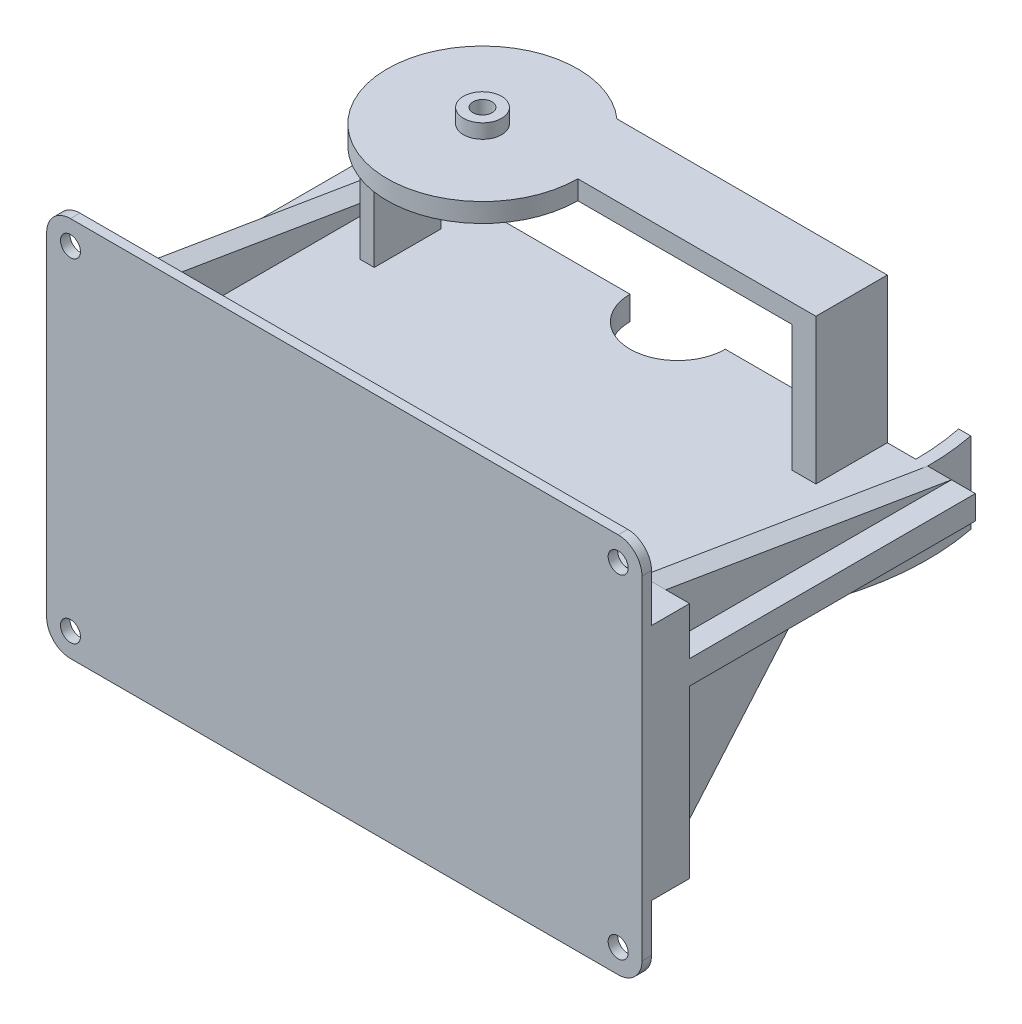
ISO-10303-21;
HEADER;
FILE_DESCRIPTION(('STEP AP214'),'2;1');
FILE_NAME('part.step','',(''),(''),'','','');
FILE_SCHEMA(('AUTOMOTIVE_DESIGN { 1 0 10303 214 1 1 1 1 }'));
ENDSEC;
DATA;
#1=APPLICATION_CONTEXT('core data for automotive mechanical design processes');
#2=APPLICATION_PROTOCOL_DEFINITION('international standard','automotive_design',2000,#1);
#3=PRODUCT_CONTEXT('',#1,'mechanical');
#4=PRODUCT('Part','Part','',(#3));
#5=PRODUCT_RELATED_PRODUCT_CATEGORY('part','',(#4));
#6=PRODUCT_DEFINITION_FORMATION('','',#4);
#7=PRODUCT_DEFINITION_CONTEXT('part definition',#1,'design');
#8=PRODUCT_DEFINITION('design','',#6,#7);
#9=PRODUCT_DEFINITION_SHAPE('','',#8);
#10=(LENGTH_UNIT() NAMED_UNIT(*) SI_UNIT(.MILLI.,.METRE.));
#11=(NAMED_UNIT(*) PLANE_ANGLE_UNIT() SI_UNIT($,.RADIAN.));
#12=(NAMED_UNIT(*) SI_UNIT($,.STERADIAN.) SOLID_ANGLE_UNIT());
#13=UNCERTAINTY_MEASURE_WITH_UNIT(LENGTH_MEASURE(1.E-05),#10,'distance_accuracy_value','');
#14=(GEOMETRIC_REPRESENTATION_CONTEXT(3) GLOBAL_UNCERTAINTY_ASSIGNED_CONTEXT((#13)) GLOBAL_UNIT_ASSIGNED_CONTEXT((#10,
#11,#12)) REPRESENTATION_CONTEXT('',''));
#15=CARTESIAN_POINT('',(0.,0.,0.));
#16=DIRECTION('',(0.,0.,1.));
#17=DIRECTION('',(1.,0.,0.));
#18=AXIS2_PLACEMENT_3D('',#15,#16,#17);
#19=CARTESIAN_POINT('',(-62.5,15.,-60.));
#20=DIRECTION('',(0.,-1.,0.));
#21=DIRECTION('',(1.,0.,0.));
#22=AXIS2_PLACEMENT_3D('',#19,#20,#21);
#23=PLANE('',#22);
#24=CARTESIAN_POINT('',(-25.9807621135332,15.,-45.0000000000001));
#25=DIRECTION('',(0.,-1.,0.));
#26=DIRECTION('',(1.,0.,0.));
#27=AXIS2_PLACEMENT_3D('',#24,#25,#26);
#28=CIRCLE('',#27,20.);
#29=CARTESIAN_POINT('',(-44.7157561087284,15.,-38.0000000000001));
#30=VERTEX_POINT('',#29);
#31=CARTESIAN_POINT('',(-44.7157561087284,15.,-52.0000000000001));
#32=VERTEX_POINT('',#31);
#33=EDGE_CURVE('E457',#30,#32,#28,.T.);
#34=ORIENTED_EDGE('',*,*,#33,.T.);
#35=DIRECTION('',(1.,0.,0.));
#36=VECTOR('',#35,1.);
#37=CARTESIAN_POINT('',(-41.7157561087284,15.,-52.0000000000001));
#38=LINE('',#37,#36);
#39=CARTESIAN_POINT('',(-41.7157561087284,15.,-52.0000000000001));
#40=VERTEX_POINT('',#39);
#41=EDGE_CURVE('E466',#32,#40,#38,.T.);
#42=ORIENTED_EDGE('',*,*,#41,.T.);
#43=DIRECTION('',(0.,0.,1.));
#44=VECTOR('',#43,1.);
#45=CARTESIAN_POINT('',(-41.7157561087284,15.,-38.0000000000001));
#46=LINE('',#45,#44);
#47=CARTESIAN_POINT('',(-41.7157561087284,15.,-38.0000000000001));
#48=VERTEX_POINT('',#47);
#49=EDGE_CURVE('E468',#40,#48,#46,.T.);
#50=ORIENTED_EDGE('',*,*,#49,.T.);
#51=DIRECTION('',(-1.,0.,0.));
#52=VECTOR('',#51,1.);
#53=CARTESIAN_POINT('',(-41.7157561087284,15.,-38.0000000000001));
#54=LINE('',#53,#52);
#55=EDGE_CURVE('E430',#48,#30,#54,.T.);
#56=ORIENTED_EDGE('',*,*,#55,.T.);
#57=EDGE_LOOP('',(#34,#42,#50,#56));
#58=FACE_BOUND('',#57,.T.);
#59=DIRECTION('',(0.,0.,-1.));
#60=VECTOR('',#59,1.);
#61=CARTESIAN_POINT('',(39.0192378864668,15.,-60.0000000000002));
#62=LINE('',#61,#60);
#63=CARTESIAN_POINT('',(39.0192378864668,15.,-45.0000000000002));
#64=VERTEX_POINT('',#63);
#65=CARTESIAN_POINT('',(39.0192378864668,15.,-60.0000000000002));
#66=VERTEX_POINT('',#65);
#67=EDGE_CURVE('E409',#64,#66,#62,.T.);
#68=ORIENTED_EDGE('',*,*,#67,.T.);
#69=DIRECTION('',(1.,0.,0.));
#70=VECTOR('',#69,1.);
#71=CARTESIAN_POINT('',(-62.5,15.,-60.));
#72=LINE('',#71,#70);
#73=CARTESIAN_POINT('',(10.,15.,-60.));
#74=VERTEX_POINT('',#73);
#75=EDGE_CURVE('E381',#74,#66,#72,.T.);
#76=ORIENTED_EDGE('',*,*,#75,.F.);
#77=CARTESIAN_POINT('',(0.,15.,-60.));
#78=DIRECTION('',(0.,-1.,0.));
#79=DIRECTION('',(1.,0.,0.));
#80=AXIS2_PLACEMENT_3D('',#77,#78,#79);
#81=CIRCLE('',#80,10.);
#82=CARTESIAN_POINT('',(-10.,15.,-60.));
#83=VERTEX_POINT('',#82);
#84=EDGE_CURVE('E472',#74,#83,#81,.T.);
#85=ORIENTED_EDGE('',*,*,#84,.T.);
#86=CARTESIAN_POINT('',(-50.,15.,-60.));
#87=VERTEX_POINT('',#86);
#88=EDGE_CURVE('E580',#87,#83,#72,.T.);
#89=ORIENTED_EDGE('',*,*,#88,.F.);
#90=CARTESIAN_POINT('',(0.,15.,-60.));
#91=DIRECTION('',(0.,-1.,0.));
#92=DIRECTION('',(1.,0.,0.));
#93=AXIS2_PLACEMENT_3D('',#90,#91,#92);
#94=CIRCLE('',#93,50.);
#95=CARTESIAN_POINT('',(-48.9897948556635,15.,-70.));
#96=VERTEX_POINT('',#95);
#97=EDGE_CURVE('E851',#87,#96,#94,.T.);
#98=ORIENTED_EDGE('',*,*,#97,.T.);
#99=DIRECTION('',(1.,0.,0.));
#100=VECTOR('',#99,1.);
#101=CARTESIAN_POINT('',(0.,15.,-70.));
#102=LINE('',#101,#100);
#103=CARTESIAN_POINT('',(-51.5388203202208,15.,-70.));
#104=VERTEX_POINT('',#103);
#105=EDGE_CURVE('E861',#104,#96,#102,.T.);
#106=ORIENTED_EDGE('',*,*,#105,.F.);
#107=CARTESIAN_POINT('',(0.,15.,-60.));
#108=DIRECTION('',(0.,-1.,0.));
#109=DIRECTION('',(1.,0.,0.));
#110=AXIS2_PLACEMENT_3D('',#107,#108,#109);
#111=CIRCLE('',#110,52.5);
#112=CARTESIAN_POINT('',(-52.5,15.,-60.));
#113=VERTEX_POINT('',#112);
#114=EDGE_CURVE('E853',#113,#104,#111,.T.);
#115=ORIENTED_EDGE('',*,*,#114,.F.);
#116=DIRECTION('',(0.,0.,1.));
#117=VECTOR('',#116,1.);
#118=CARTESIAN_POINT('',(-52.5,15.,0.));
#119=LINE('',#118,#117);
#120=CARTESIAN_POINT('',(-52.5,15.,0.));
#121=VERTEX_POINT('',#120);
#122=EDGE_CURVE('E885',#113,#121,#119,.T.);
#123=ORIENTED_EDGE('',*,*,#122,.T.);
#124=DIRECTION('',(1.,0.,0.));
#125=VECTOR('',#124,1.);
#126=CARTESIAN_POINT('',(-62.5,15.,0.));
#127=LINE('',#126,#125);
#128=CARTESIAN_POINT('',(52.5,15.,0.));
#129=VERTEX_POINT('',#128);
#130=EDGE_CURVE('E738',#121,#129,#127,.T.);
#131=ORIENTED_EDGE('',*,*,#130,.T.);
#132=DIRECTION('',(0.,0.,1.));
#133=VECTOR('',#132,1.);
#134=CARTESIAN_POINT('',(52.5,15.,0.));
#135=LINE('',#134,#133);
#136=CARTESIAN_POINT('',(52.5,15.,-60.));
#137=VERTEX_POINT('',#136);
#138=EDGE_CURVE('E593',#137,#129,#135,.T.);
#139=ORIENTED_EDGE('',*,*,#138,.F.);
#140=CARTESIAN_POINT('',(51.5388203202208,15.,-70.));
#141=VERTEX_POINT('',#140);
#142=EDGE_CURVE('E859',#141,#137,#111,.T.);
#143=ORIENTED_EDGE('',*,*,#142,.F.);
#144=DIRECTION('',(1.,0.,0.));
#145=VECTOR('',#144,1.);
#146=CARTESIAN_POINT('',(0.,15.,-70.));
#147=LINE('',#146,#145);
#148=CARTESIAN_POINT('',(48.9897948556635,15.,-70.));
#149=VERTEX_POINT('',#148);
#150=EDGE_CURVE('E850',#149,#141,#147,.T.);
#151=ORIENTED_EDGE('',*,*,#150,.F.);
#152=CARTESIAN_POINT('',(50.,15.,-60.));
#153=VERTEX_POINT('',#152);
#154=EDGE_CURVE('E844',#149,#153,#94,.T.);
#155=ORIENTED_EDGE('',*,*,#154,.T.);
#156=CARTESIAN_POINT('',(44.0192378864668,15.,-60.));
#157=VERTEX_POINT('',#156);
#158=EDGE_CURVE('E576',#157,#153,#72,.T.);
#159=ORIENTED_EDGE('',*,*,#158,.F.);
#160=DIRECTION('',(0.,0.,1.));
#161=VECTOR('',#160,1.);
#162=CARTESIAN_POINT('',(44.0192378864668,15.,-60.0000000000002));
#163=LINE('',#162,#161);
#164=CARTESIAN_POINT('',(44.0192378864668,15.,-45.0000000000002));
#165=VERTEX_POINT('',#164);
#166=EDGE_CURVE('E1763',#157,#165,#163,.T.);
#167=ORIENTED_EDGE('',*,*,#166,.T.);
#168=DIRECTION('',(-1.,0.,0.));
#169=VECTOR('',#168,1.);
#170=CARTESIAN_POINT('',(44.0192378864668,15.,-45.0000000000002));
#171=LINE('',#170,#169);
#172=EDGE_CURVE('E1762',#165,#64,#171,.T.);
#173=ORIENTED_EDGE('',*,*,#172,.T.);
#174=EDGE_LOOP('',(#68,#76,#85,#89,#98,#106,#115,#123,#131,#139,#143,#151,#155,#159,#167,#173));
#175=FACE_BOUND('',#174,.T.);
#176=ADVANCED_FACE('F38',(#58,#175),#23,.F.);
#177=CARTESIAN_POINT('',(-25.9807621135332,41.5,-45.0000000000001));
#178=DIRECTION('',(0.,1.,0.));
#179=DIRECTION('',(-1.,0.,0.));
#180=AXIS2_PLACEMENT_3D('',#177,#178,#179);
#181=PLANE('',#180);
#182=CARTESIAN_POINT('',(-25.9807621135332,41.5,-45.0000000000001));
#183=DIRECTION('',(0.,1.,0.));
#184=DIRECTION('',(-1.,0.,0.));
#185=AXIS2_PLACEMENT_3D('',#182,#183,#184);
#186=CIRCLE('',#185,3.99999999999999);
#187=CARTESIAN_POINT('',(-29.9807621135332,41.5,-45.0000000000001));
#188=VERTEX_POINT('',#187);
#189=EDGE_CURVE('E427',#188,#188,#186,.T.);
#190=ORIENTED_EDGE('',*,*,#189,.T.);
#191=EDGE_LOOP('',(#190));
#192=FACE_BOUND('',#191,.T.);
#193=DIRECTION('',(0.,0.,-1.));
#194=VECTOR('',#193,1.);
#195=CARTESIAN_POINT('',(39.0192378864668,41.5,-60.0000000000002));
#196=LINE('',#195,#194);
#197=CARTESIAN_POINT('',(39.0192378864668,41.5,-45.0000000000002));
#198=VERTEX_POINT('',#197);
#199=CARTESIAN_POINT('',(39.0192378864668,41.5,-60.0000000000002));
#200=VERTEX_POINT('',#199);
#201=EDGE_CURVE('E385',#198,#200,#196,.T.);
#202=ORIENTED_EDGE('',*,*,#201,.F.);
#203=DIRECTION('',(1.,0.,0.));
#204=VECTOR('',#203,1.);
#205=CARTESIAN_POINT('',(44.0192378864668,41.5,-45.0000000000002));
#206=LINE('',#205,#204);
#207=CARTESIAN_POINT('',(-5.98076211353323,41.5,-45.0000000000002));
#208=VERTEX_POINT('',#207);
#209=EDGE_CURVE('E399',#208,#198,#206,.T.);
#210=ORIENTED_EDGE('',*,*,#209,.F.);
#211=CARTESIAN_POINT('',(-25.9807621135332,41.5,-45.0000000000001));
#212=DIRECTION('',(0.,1.,0.));
#213=DIRECTION('',(-1.,0.,0.));
#214=AXIS2_PLACEMENT_3D('',#211,#212,#213);
#215=CIRCLE('',#214,20.);
#216=CARTESIAN_POINT('',(-44.7157561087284,41.5,-38.0000000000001));
#217=VERTEX_POINT('',#216);
#218=EDGE_CURVE('E419',#217,#208,#215,.T.);
#219=ORIENTED_EDGE('',*,*,#218,.F.);
#220=DIRECTION('',(-1.,0.,0.));
#221=VECTOR('',#220,1.);
#222=CARTESIAN_POINT('',(-41.7157561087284,41.5,-38.0000000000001));
#223=LINE('',#222,#221);
#224=CARTESIAN_POINT('',(-41.7157561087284,41.5,-38.0000000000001));
#225=VERTEX_POINT('',#224);
#226=EDGE_CURVE('E446',#225,#217,#223,.T.);
#227=ORIENTED_EDGE('',*,*,#226,.F.);
#228=DIRECTION('',(0.,0.,1.));
#229=VECTOR('',#228,1.);
#230=CARTESIAN_POINT('',(-41.7157561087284,41.5,-38.0000000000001));
#231=LINE('',#230,#229);
#232=CARTESIAN_POINT('',(-41.7157561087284,41.5,-52.0000000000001));
#233=VERTEX_POINT('',#232);
#234=EDGE_CURVE('E442',#233,#225,#231,.T.);
#235=ORIENTED_EDGE('',*,*,#234,.F.);
#236=DIRECTION('',(1.,0.,0.));
#237=VECTOR('',#236,1.);
#238=CARTESIAN_POINT('',(-41.7157561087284,41.5,-52.0000000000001));
#239=LINE('',#238,#237);
#240=CARTESIAN_POINT('',(-44.7157561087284,41.5,-52.0000000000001));
#241=VERTEX_POINT('',#240);
#242=EDGE_CURVE('E445',#241,#233,#239,.T.);
#243=ORIENTED_EDGE('',*,*,#242,.F.);
#244=CARTESIAN_POINT('',(-12.7520055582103,41.5,-60.0000000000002));
#245=VERTEX_POINT('',#244);
#246=EDGE_CURVE('E397',#245,#241,#215,.T.);
#247=ORIENTED_EDGE('',*,*,#246,.F.);
#248=DIRECTION('',(-1.,0.,0.));
#249=VECTOR('',#248,1.);
#250=CARTESIAN_POINT('',(44.0192378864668,41.5,-60.0000000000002));
#251=LINE('',#250,#249);
#252=EDGE_CURVE('E377',#200,#245,#251,.T.);
#253=ORIENTED_EDGE('',*,*,#252,.F.);
#254=EDGE_LOOP('',(#202,#210,#219,#227,#235,#243,#247,#253));
#255=FACE_BOUND('',#254,.T.);
#256=ADVANCED_FACE('F395',(#192,#255),#181,.F.);
#257=CARTESIAN_POINT('',(0.,0.,-60.));
#258=DIRECTION('',(0.,0.,1.));
#259=DIRECTION('',(1.,0.,0.));
#260=AXIS2_PLACEMENT_3D('',#257,#258,#259);
#261=PLANE('',#260);
#262=ORIENTED_EDGE('',*,*,#88,.T.);
#263=DIRECTION('',(0.,-1.,0.));
#264=VECTOR('',#263,1.);
#265=CARTESIAN_POINT('',(-10.,20.,-60.));
#266=LINE('',#265,#264);
#267=CARTESIAN_POINT('',(-10.,9.99999999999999,-60.));
#268=VERTEX_POINT('',#267);
#269=EDGE_CURVE('E11',#83,#268,#266,.T.);
#270=ORIENTED_EDGE('',*,*,#269,.T.);
#271=DIRECTION('',(-1.,0.,0.));
#272=VECTOR('',#271,1.);
#273=CARTESIAN_POINT('',(-62.5,10.,-60.));
#274=LINE('',#273,#272);
#275=CARTESIAN_POINT('',(-50.,10.,-60.));
#276=VERTEX_POINT('',#275);
#277=EDGE_CURVE('E728',#268,#276,#274,.T.);
#278=ORIENTED_EDGE('',*,*,#277,.T.);
#279=DIRECTION('',(0.,1.,0.));
#280=VECTOR('',#279,1.);
#281=CARTESIAN_POINT('',(-50.,-2.,-60.));
#282=LINE('',#281,#280);
#283=EDGE_CURVE('E827',#276,#87,#282,.T.);
#284=ORIENTED_EDGE('',*,*,#283,.T.);
#285=EDGE_LOOP('',(#262,#270,#278,#284));
#286=FACE_BOUND('',#285,.T.);
#287=ADVANCED_FACE('F540',(#286),#261,.F.);
#288=CARTESIAN_POINT('',(-62.5,10.,-60.));
#289=DIRECTION('',(0.,1.,0.));
#290=DIRECTION('',(-1.,0.,0.));
#291=AXIS2_PLACEMENT_3D('',#288,#289,#290);
#292=PLANE('',#291);
#293=ORIENTED_EDGE('',*,*,#277,.F.);
#294=CARTESIAN_POINT('',(0.,9.99999999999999,-60.));
#295=DIRECTION('',(0.,-1.,0.));
#296=DIRECTION('',(1.,0.,0.));
#297=AXIS2_PLACEMENT_3D('',#294,#295,#296);
#298=CIRCLE('',#297,10.);
#299=CARTESIAN_POINT('',(10.,9.99999999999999,-60.));
#300=VERTEX_POINT('',#299);
#301=EDGE_CURVE('E449',#300,#268,#298,.T.);
#302=ORIENTED_EDGE('',*,*,#301,.F.);
#303=CARTESIAN_POINT('',(50.,9.99999999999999,-60.));
#304=VERTEX_POINT('',#303);
#305=EDGE_CURVE('E727',#304,#300,#274,.T.);
#306=ORIENTED_EDGE('',*,*,#305,.F.);
#307=CARTESIAN_POINT('',(0.,9.99999999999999,-60.));
#308=DIRECTION('',(0.,1.,0.));
#309=DIRECTION('',(-1.,0.,0.));
#310=AXIS2_PLACEMENT_3D('',#307,#308,#309);
#311=CIRCLE('',#310,50.);
#312=EDGE_CURVE('E847',#304,#276,#311,.F.);
#313=ORIENTED_EDGE('',*,*,#312,.T.);
#314=EDGE_LOOP('',(#293,#302,#306,#313));
#315=FACE_BOUND('',#314,.T.);
#316=ADVANCED_FACE('F1002',(#315),#292,.F.);
#317=DIRECTION('',(0.,1.,0.));
#318=VECTOR('',#317,1.);
#319=CARTESIAN_POINT('',(52.5,-2.00000000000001,-60.));
#320=LINE('',#319,#318);
#321=CARTESIAN_POINT('',(52.5,9.99999999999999,-60.));
#322=VERTEX_POINT('',#321);
#323=EDGE_CURVE('E587',#137,#322,#320,.F.);
#324=ORIENTED_EDGE('',*,*,#323,.F.);
#325=DIRECTION('',(1.,0.,0.));
#326=VECTOR('',#325,1.);
#327=CARTESIAN_POINT('',(52.5,15.,-60.));
#328=LINE('',#327,#326);
#329=CARTESIAN_POINT('',(57.5,15.,-60.));
#330=VERTEX_POINT('',#329);
#331=EDGE_CURVE('E583',#137,#330,#328,.T.);
#332=ORIENTED_EDGE('',*,*,#331,.T.);
#333=CARTESIAN_POINT('',(62.5,15.,-60.));
#334=VERTEX_POINT('',#333);
#335=EDGE_CURVE('E567',#330,#334,#72,.T.);
#336=ORIENTED_EDGE('',*,*,#335,.T.);
#337=DIRECTION('',(0.,-1.,0.));
#338=VECTOR('',#337,1.);
#339=CARTESIAN_POINT('',(62.5,15.,-60.));
#340=LINE('',#339,#338);
#341=CARTESIAN_POINT('',(62.5,9.99999999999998,-60.));
#342=VERTEX_POINT('',#341);
#343=EDGE_CURVE('E721',#334,#342,#340,.T.);
#344=ORIENTED_EDGE('',*,*,#343,.T.);
#345=EDGE_CURVE('E725',#342,#322,#274,.T.);
#346=ORIENTED_EDGE('',*,*,#345,.T.);
#347=EDGE_LOOP('',(#324,#332,#336,#344,#346));
#348=FACE_BOUND('',#347,.T.);
#349=ADVANCED_FACE('F584',(#348),#261,.F.);
#350=DIRECTION('',(0.,1.,0.));
#351=VECTOR('',#350,1.);
#352=CARTESIAN_POINT('',(-52.5,-2.,-60.));
#353=LINE('',#352,#351);
#354=CARTESIAN_POINT('',(-52.5,10.,-60.));
#355=VERTEX_POINT('',#354);
#356=EDGE_CURVE('E876',#355,#113,#353,.T.);
#357=ORIENTED_EDGE('',*,*,#356,.F.);
#358=CARTESIAN_POINT('',(-62.5,10.,-60.));
#359=VERTEX_POINT('',#358);
#360=EDGE_CURVE('E723',#355,#359,#274,.T.);
#361=ORIENTED_EDGE('',*,*,#360,.T.);
#362=DIRECTION('',(0.,1.,0.));
#363=VECTOR('',#362,1.);
#364=CARTESIAN_POINT('',(-62.5,15.,-60.));
#365=LINE('',#364,#363);
#366=CARTESIAN_POINT('',(-62.5,15.,-60.));
#367=VERTEX_POINT('',#366);
#368=EDGE_CURVE('E577',#359,#367,#365,.T.);
#369=ORIENTED_EDGE('',*,*,#368,.T.);
#370=CARTESIAN_POINT('',(-57.5,15.,-60.));
#371=VERTEX_POINT('',#370);
#372=EDGE_CURVE('E579',#367,#371,#72,.T.);
#373=ORIENTED_EDGE('',*,*,#372,.T.);
#374=DIRECTION('',(-1.,0.,0.));
#375=VECTOR('',#374,1.);
#376=CARTESIAN_POINT('',(-52.5,15.,-60.));
#377=LINE('',#376,#375);
#378=EDGE_CURVE('E900',#113,#371,#377,.T.);
#379=ORIENTED_EDGE('',*,*,#378,.F.);
#380=EDGE_LOOP('',(#357,#361,#369,#373,#379));
#381=FACE_BOUND('',#380,.T.);
#382=ADVANCED_FACE('F558',(#381),#261,.F.);
#383=CARTESIAN_POINT('',(0.,0.,0.));
#384=DIRECTION('',(0.,0.,-1.));
#385=DIRECTION('',(-1.,0.,0.));
#386=AXIS2_PLACEMENT_3D('',#383,#384,#385);
#387=PLANE('',#386);
#388=ORIENTED_EDGE('',*,*,#130,.F.);
#389=DIRECTION('',(0.,1.,0.));
#390=VECTOR('',#389,1.);
#391=CARTESIAN_POINT('',(-52.5,25.,0.));
#392=LINE('',#391,#390);
#393=CARTESIAN_POINT('',(-52.5,25.,0.));
#394=VERTEX_POINT('',#393);
#395=EDGE_CURVE('E888',#121,#394,#392,.T.);
#396=ORIENTED_EDGE('',*,*,#395,.T.);
#397=DIRECTION('',(-1.,0.,0.));
#398=VECTOR('',#397,1.);
#399=CARTESIAN_POINT('',(62.5,25.,0.));
#400=LINE('',#399,#398);
#401=CARTESIAN_POINT('',(52.5,25.,0.));
#402=VERTEX_POINT('',#401);
#403=EDGE_CURVE('E771',#402,#394,#400,.T.);
#404=ORIENTED_EDGE('',*,*,#403,.F.);
#405=DIRECTION('',(0.,1.,0.));
#406=VECTOR('',#405,1.);
#407=CARTESIAN_POINT('',(52.5,25.,0.));
#408=LINE('',#407,#406);
#409=EDGE_CURVE('E610',#129,#402,#408,.T.);
#410=ORIENTED_EDGE('',*,*,#409,.F.);
#411=EDGE_LOOP('',(#388,#396,#404,#410));
#412=FACE_BOUND('',#411,.T.);
#413=ADVANCED_FACE('F562',(#412),#387,.T.);
#414=CARTESIAN_POINT('',(-52.5,-25.,0.));
#415=DIRECTION('',(0.,-0.650791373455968,-0.759256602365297));
#416=DIRECTION('',(0.,0.759256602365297,-0.650791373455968));
#417=AXIS2_PLACEMENT_3D('',#414,#415,#416);
#418=PLANE('',#417);
#419=DIRECTION('',(0.,-0.759256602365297,0.650791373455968));
#420=VECTOR('',#419,1.);
#421=CARTESIAN_POINT('',(-57.5,-25.,0.));
#422=LINE('',#421,#420);
#423=CARTESIAN_POINT('',(-57.5,10.,-30.));
#424=VERTEX_POINT('',#423);
#425=CARTESIAN_POINT('',(-57.5,-25.,0.));
#426=VERTEX_POINT('',#425);
#427=EDGE_CURVE('E808',#424,#426,#422,.T.);
#428=ORIENTED_EDGE('',*,*,#427,.F.);
#429=DIRECTION('',(-1.,0.,0.));
#430=VECTOR('',#429,1.);
#431=CARTESIAN_POINT('',(-52.5,10.,-30.));
#432=LINE('',#431,#430);
#433=CARTESIAN_POINT('',(-52.5,9.99999999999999,-30.));
#434=VERTEX_POINT('',#433);
#435=EDGE_CURVE('E825',#434,#424,#432,.T.);
#436=ORIENTED_EDGE('',*,*,#435,.F.);
#437=DIRECTION('',(0.,-0.759256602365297,0.650791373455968));
#438=VECTOR('',#437,1.);
#439=CARTESIAN_POINT('',(-52.5,-25.,0.));
#440=LINE('',#439,#438);
#441=CARTESIAN_POINT('',(-52.5,-25.,0.));
#442=VERTEX_POINT('',#441);
#443=EDGE_CURVE('E809',#434,#442,#440,.T.);
#444=ORIENTED_EDGE('',*,*,#443,.T.);
#445=DIRECTION('',(-1.,0.,0.));
#446=VECTOR('',#445,1.);
#447=CARTESIAN_POINT('',(-52.5,-25.,0.));
#448=LINE('',#447,#446);
#449=EDGE_CURVE('E817',#442,#426,#448,.T.);
#450=ORIENTED_EDGE('',*,*,#449,.T.);
#451=EDGE_LOOP('',(#428,#436,#444,#450));
#452=FACE_BOUND('',#451,.T.);
#453=ADVANCED_FACE('F40',(#452),#418,.T.);
#454=CARTESIAN_POINT('',(-52.5,0.,0.));
#455=DIRECTION('',(-1.,0.,0.));
#456=DIRECTION('',(0.,-1.,0.));
#457=AXIS2_PLACEMENT_3D('',#454,#455,#456);
#458=PLANE('',#457);
#459=ORIENTED_EDGE('',*,*,#443,.F.);
#460=DIRECTION('',(0.,0.,-1.));
#461=VECTOR('',#460,1.);
#462=CARTESIAN_POINT('',(-52.5,10.,0.));
#463=LINE('',#462,#461);
#464=CARTESIAN_POINT('',(-52.5,10.,0.));
#465=VERTEX_POINT('',#464);
#466=EDGE_CURVE('E815',#465,#434,#463,.T.);
#467=ORIENTED_EDGE('',*,*,#466,.F.);
#468=DIRECTION('',(0.,1.,0.));
#469=VECTOR('',#468,1.);
#470=CARTESIAN_POINT('',(-52.5,-25.,0.));
#471=LINE('',#470,#469);
#472=EDGE_CURVE('E812',#442,#465,#471,.T.);
#473=ORIENTED_EDGE('',*,*,#472,.F.);
#474=EDGE_LOOP('',(#459,#467,#473));
#475=FACE_BOUND('',#474,.T.);
#476=ADVANCED_FACE('F1115',(#475),#458,.F.);
#477=CARTESIAN_POINT('',(-57.5,0.,0.));
#478=DIRECTION('',(-1.,0.,0.));
#479=DIRECTION('',(0.,-1.,0.));
#480=AXIS2_PLACEMENT_3D('',#477,#478,#479);
#481=PLANE('',#480);
#482=ORIENTED_EDGE('',*,*,#427,.T.);
#483=DIRECTION('',(0.,1.,0.));
#484=VECTOR('',#483,1.);
#485=CARTESIAN_POINT('',(-57.5,-25.,0.));
#486=LINE('',#485,#484);
#487=CARTESIAN_POINT('',(-57.5,10.,0.));
#488=VERTEX_POINT('',#487);
#489=EDGE_CURVE('E820',#426,#488,#486,.T.);
#490=ORIENTED_EDGE('',*,*,#489,.T.);
#491=DIRECTION('',(0.,0.,-1.));
#492=VECTOR('',#491,1.);
#493=CARTESIAN_POINT('',(-57.5,10.,0.));
#494=LINE('',#493,#492);
#495=EDGE_CURVE('E813',#488,#424,#494,.T.);
#496=ORIENTED_EDGE('',*,*,#495,.T.);
#497=EDGE_LOOP('',(#482,#490,#496));
#498=FACE_BOUND('',#497,.T.);
#499=ADVANCED_FACE('F1113',(#498),#481,.T.);
#500=ORIENTED_EDGE('',*,*,#472,.T.);
#501=DIRECTION('',(-1.,0.,0.));
#502=VECTOR('',#501,1.);
#503=CARTESIAN_POINT('',(-62.5,10.,0.));
#504=LINE('',#503,#502);
#505=CARTESIAN_POINT('',(52.5,10.,0.));
#506=VERTEX_POINT('',#505);
#507=EDGE_CURVE('E735',#506,#465,#504,.T.);
#508=ORIENTED_EDGE('',*,*,#507,.F.);
#509=DIRECTION('',(0.,1.,0.));
#510=VECTOR('',#509,1.);
#511=CARTESIAN_POINT('',(52.5,-25.,0.));
#512=LINE('',#511,#510);
#513=CARTESIAN_POINT('',(52.5,-25.,0.));
#514=VERTEX_POINT('',#513);
#515=EDGE_CURVE('E632',#514,#506,#512,.T.);
#516=ORIENTED_EDGE('',*,*,#515,.F.);
#517=DIRECTION('',(1.,0.,0.));
#518=VECTOR('',#517,1.);
#519=CARTESIAN_POINT('',(62.5,-25.,0.));
#520=LINE('',#519,#518);
#521=CARTESIAN_POINT('',(45.,-25.,0.));
#522=VERTEX_POINT('',#521);
#523=EDGE_CURVE('E936',#522,#514,#520,.T.);
#524=ORIENTED_EDGE('',*,*,#523,.F.);
#525=DIRECTION('',(0.,1.,0.));
#526=VECTOR('',#525,1.);
#527=CARTESIAN_POINT('',(45.,-130.553851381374,0.));
#528=LINE('',#527,#526);
#529=CARTESIAN_POINT('',(45.,-35.,0.));
#530=VERTEX_POINT('',#529);
#531=EDGE_CURVE('E908',#530,#522,#528,.T.);
#532=ORIENTED_EDGE('',*,*,#531,.F.);
#533=CARTESIAN_POINT('',(40.,-35.,0.));
#534=DIRECTION('',(0.,0.,-1.));
#535=DIRECTION('',(-1.,0.,0.));
#536=AXIS2_PLACEMENT_3D('',#533,#534,#535);
#537=CIRCLE('',#536,5.);
#538=CARTESIAN_POINT('',(40.,-40.,0.));
#539=VERTEX_POINT('',#538);
#540=EDGE_CURVE('E798',#530,#539,#537,.T.);
#541=ORIENTED_EDGE('',*,*,#540,.T.);
#542=DIRECTION('',(1.,0.,0.));
#543=VECTOR('',#542,1.);
#544=CARTESIAN_POINT('',(0.,-40.,0.));
#545=LINE('',#544,#543);
#546=CARTESIAN_POINT('',(-40.,-40.,0.));
#547=VERTEX_POINT('',#546);
#548=EDGE_CURVE('E911',#547,#539,#545,.T.);
#549=ORIENTED_EDGE('',*,*,#548,.F.);
#550=CARTESIAN_POINT('',(-40.,-35.,0.));
#551=DIRECTION('',(0.,0.,-1.));
#552=DIRECTION('',(-1.,0.,0.));
#553=AXIS2_PLACEMENT_3D('',#550,#551,#552);
#554=CIRCLE('',#553,5.);
#555=CARTESIAN_POINT('',(-45.,-35.,0.));
#556=VERTEX_POINT('',#555);
#557=EDGE_CURVE('E796',#547,#556,#554,.T.);
#558=ORIENTED_EDGE('',*,*,#557,.T.);
#559=DIRECTION('',(0.,1.,0.));
#560=VECTOR('',#559,1.);
#561=CARTESIAN_POINT('',(-45.,-130.553851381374,0.));
#562=LINE('',#561,#560);
#563=CARTESIAN_POINT('',(-45.,-25.,0.));
#564=VERTEX_POINT('',#563);
#565=EDGE_CURVE('E902',#556,#564,#562,.T.);
#566=ORIENTED_EDGE('',*,*,#565,.T.);
#567=EDGE_CURVE('E764',#442,#564,#520,.T.);
#568=ORIENTED_EDGE('',*,*,#567,.F.);
#569=EDGE_LOOP('',(#500,#508,#516,#524,#532,#541,#549,#558,#566,#568));
#570=FACE_BOUND('',#569,.T.);
#571=ADVANCED_FACE('F937',(#570),#387,.T.);
#572=CARTESIAN_POINT('',(0.,9.99999999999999,-60.));
#573=DIRECTION('',(0.,1.,0.));
#574=DIRECTION('',(-1.,0.,0.));
#575=AXIS2_PLACEMENT_3D('',#572,#573,#574);
#576=CIRCLE('',#575,52.5);
#577=EDGE_CURVE('E879',#322,#355,#576,.F.);
#578=ORIENTED_EDGE('',*,*,#577,.F.);
#579=ORIENTED_EDGE('',*,*,#345,.F.);
#580=DIRECTION('',(0.,0.,1.));
#581=VECTOR('',#580,1.);
#582=CARTESIAN_POINT('',(62.5,9.99999999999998,-60.));
#583=LINE('',#582,#581);
#584=CARTESIAN_POINT('',(62.5,9.99999999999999,0.));
#585=VERTEX_POINT('',#584);
#586=EDGE_CURVE('E746',#342,#585,#583,.T.);
#587=ORIENTED_EDGE('',*,*,#586,.T.);
#588=CARTESIAN_POINT('',(57.5,10.,0.));
#589=VERTEX_POINT('',#588);
#590=EDGE_CURVE('E731',#585,#589,#504,.T.);
#591=ORIENTED_EDGE('',*,*,#590,.T.);
#592=DIRECTION('',(0.,0.,-1.));
#593=VECTOR('',#592,1.);
#594=CARTESIAN_POINT('',(57.5,10.,0.));
#595=LINE('',#594,#593);
#596=CARTESIAN_POINT('',(57.5,9.99999999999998,-30.));
#597=VERTEX_POINT('',#596);
#598=EDGE_CURVE('E624',#589,#597,#595,.T.);
#599=ORIENTED_EDGE('',*,*,#598,.T.);
#600=DIRECTION('',(1.,0.,0.));
#601=VECTOR('',#600,1.);
#602=CARTESIAN_POINT('',(52.5,10.,-30.));
#603=LINE('',#602,#601);
#604=CARTESIAN_POINT('',(52.5,10.,-30.));
#605=VERTEX_POINT('',#604);
#606=EDGE_CURVE('E615',#605,#597,#603,.T.);
#607=ORIENTED_EDGE('',*,*,#606,.F.);
#608=DIRECTION('',(0.,0.,-1.));
#609=VECTOR('',#608,1.);
#610=CARTESIAN_POINT('',(52.5,10.,0.));
#611=LINE('',#610,#609);
#612=EDGE_CURVE('E627',#506,#605,#611,.T.);
#613=ORIENTED_EDGE('',*,*,#612,.F.);
#614=ORIENTED_EDGE('',*,*,#507,.T.);
#615=ORIENTED_EDGE('',*,*,#466,.T.);
#616=ORIENTED_EDGE('',*,*,#435,.T.);
#617=ORIENTED_EDGE('',*,*,#495,.F.);
#618=CARTESIAN_POINT('',(-62.5,10.,0.));
#619=VERTEX_POINT('',#618);
#620=EDGE_CURVE('E720',#488,#619,#504,.T.);
#621=ORIENTED_EDGE('',*,*,#620,.T.);
#622=DIRECTION('',(0.,0.,1.));
#623=VECTOR('',#622,1.);
#624=CARTESIAN_POINT('',(-62.5,10.,-60.));
#625=LINE('',#624,#623);
#626=EDGE_CURVE('E743',#359,#619,#625,.T.);
#627=ORIENTED_EDGE('',*,*,#626,.F.);
#628=ORIENTED_EDGE('',*,*,#360,.F.);
#629=EDGE_LOOP('',(#578,#579,#587,#591,#599,#607,#613,#614,#615,#616,#617,#621,#627,#628));
#630=FACE_BOUND('',#629,.T.);
#631=ADVANCED_FACE('F987',(#630),#292,.F.);
#632=CARTESIAN_POINT('',(62.5,-25.,10.));
#633=DIRECTION('',(0.,1.,0.));
#634=DIRECTION('',(-1.,0.,0.));
#635=AXIS2_PLACEMENT_3D('',#632,#633,#634);
#636=PLANE('',#635);
#637=DIRECTION('',(0.,0.,1.));
#638=VECTOR('',#637,1.);
#639=CARTESIAN_POINT('',(45.,-25.,0.));
#640=LINE('',#639,#638);
#641=CARTESIAN_POINT('',(45.,-25.,8.));
#642=VERTEX_POINT('',#641);
#643=EDGE_CURVE('E905',#522,#642,#640,.T.);
#644=ORIENTED_EDGE('',*,*,#643,.F.);
#645=ORIENTED_EDGE('',*,*,#523,.T.);
#646=DIRECTION('',(1.,0.,0.));
#647=VECTOR('',#646,1.);
#648=CARTESIAN_POINT('',(52.5,-25.,0.));
#649=LINE('',#648,#647);
#650=CARTESIAN_POINT('',(57.5,-25.,0.));
#651=VERTEX_POINT('',#650);
#652=EDGE_CURVE('E621',#514,#651,#649,.T.);
#653=ORIENTED_EDGE('',*,*,#652,.T.);
#654=CARTESIAN_POINT('',(62.5,-25.,0.));
#655=VERTEX_POINT('',#654);
#656=EDGE_CURVE('E759',#651,#655,#520,.T.);
#657=ORIENTED_EDGE('',*,*,#656,.T.);
#658=DIRECTION('',(0.,0.,-1.));
#659=VECTOR('',#658,1.);
#660=CARTESIAN_POINT('',(62.5,-25.,10.));
#661=LINE('',#660,#659);
#662=CARTESIAN_POINT('',(62.5,-25.,8.));
#663=VERTEX_POINT('',#662);
#664=EDGE_CURVE('E776',#663,#655,#661,.T.);
#665=ORIENTED_EDGE('',*,*,#664,.F.);
#666=DIRECTION('',(1.,0.,0.));
#667=VECTOR('',#666,1.);
#668=CARTESIAN_POINT('',(62.5,-25.,8.));
#669=LINE('',#668,#667);
#670=EDGE_CURVE('E698',#642,#663,#669,.T.);
#671=ORIENTED_EDGE('',*,*,#670,.F.);
#672=EDGE_LOOP('',(#644,#645,#653,#657,#665,#671));
#673=FACE_BOUND('',#672,.T.);
#674=ADVANCED_FACE('F969',(#673),#636,.F.);
#675=CARTESIAN_POINT('',(-57.5,35.,8.));
#676=DIRECTION('',(0.,0.,1.));
#677=DIRECTION('',(1.,0.,0.));
#678=AXIS2_PLACEMENT_3D('',#675,#676,#677);
#679=PLANE('',#678);
#680=CARTESIAN_POINT('',(57.5,-35.,8.));
#681=DIRECTION('',(0.,0.,1.));
#682=DIRECTION('',(1.,0.,0.));
#683=AXIS2_PLACEMENT_3D('',#680,#681,#682);
#684=CIRCLE('',#683,2.1);
#685=CARTESIAN_POINT('',(59.6,-35.,8.));
#686=VERTEX_POINT('',#685);
#687=EDGE_CURVE('E647',#686,#686,#684,.T.);
#688=ORIENTED_EDGE('',*,*,#687,.T.);
#689=EDGE_LOOP('',(#688));
#690=FACE_BOUND('',#689,.T.);
#691=DIRECTION('',(0.,-1.,0.));
#692=VECTOR('',#691,1.);
#693=CARTESIAN_POINT('',(45.,35.,8.));
#694=LINE('',#693,#692);
#695=CARTESIAN_POINT('',(45.,-35.,8.));
#696=VERTEX_POINT('',#695);
#697=EDGE_CURVE('E914',#642,#696,#694,.T.);
#698=ORIENTED_EDGE('',*,*,#697,.F.);
#699=ORIENTED_EDGE('',*,*,#670,.T.);
#700=DIRECTION('',(0.,1.,0.));
#701=VECTOR('',#700,1.);
#702=CARTESIAN_POINT('',(62.5,35.,8.));
#703=LINE('',#702,#701);
#704=CARTESIAN_POINT('',(62.5,-35.,8.));
#705=VERTEX_POINT('',#704);
#706=EDGE_CURVE('E670',#705,#663,#703,.T.);
#707=ORIENTED_EDGE('',*,*,#706,.F.);
#708=CARTESIAN_POINT('',(57.5,-35.,8.));
#709=DIRECTION('',(0.,0.,1.));
#710=DIRECTION('',(-1.,0.,0.));
#711=AXIS2_PLACEMENT_3D('',#708,#709,#710);
#712=CIRCLE('',#711,5.);
#713=CARTESIAN_POINT('',(57.5,-40.,8.));
#714=VERTEX_POINT('',#713);
#715=EDGE_CURVE('E666',#714,#705,#712,.T.);
#716=ORIENTED_EDGE('',*,*,#715,.F.);
#717=DIRECTION('',(1.,0.,0.));
#718=VECTOR('',#717,1.);
#719=CARTESIAN_POINT('',(57.5,-40.,8.));
#720=LINE('',#719,#718);
#721=CARTESIAN_POINT('',(40.,-40.,8.));
#722=VERTEX_POINT('',#721);
#723=EDGE_CURVE('E663',#722,#714,#720,.T.);
#724=ORIENTED_EDGE('',*,*,#723,.F.);
#725=CARTESIAN_POINT('',(40.,-35.,8.));
#726=DIRECTION('',(0.,0.,1.));
#727=DIRECTION('',(1.,0.,0.));
#728=AXIS2_PLACEMENT_3D('',#725,#726,#727);
#729=CIRCLE('',#728,5.);
#730=EDGE_CURVE('E803',#722,#696,#729,.T.);
#731=ORIENTED_EDGE('',*,*,#730,.T.);
#732=EDGE_LOOP('',(#698,#699,#707,#716,#724,#731));
#733=FACE_BOUND('',#732,.T.);
#734=ADVANCED_FACE('F961',(#690,#733),#679,.F.);
#735=DIRECTION('',(0.,1.,0.));
#736=VECTOR('',#735,1.);
#737=CARTESIAN_POINT('',(-57.5,25.,0.));
#738=LINE('',#737,#736);
#739=CARTESIAN_POINT('',(-57.5,15.,0.));
#740=VERTEX_POINT('',#739);
#741=CARTESIAN_POINT('',(-57.5,25.,0.));
#742=VERTEX_POINT('',#741);
#743=EDGE_CURVE('E896',#740,#742,#738,.T.);
#744=ORIENTED_EDGE('',*,*,#743,.F.);
#745=CARTESIAN_POINT('',(-62.5,15.,0.));
#746=VERTEX_POINT('',#745);
#747=EDGE_CURVE('E724',#746,#740,#127,.T.);
#748=ORIENTED_EDGE('',*,*,#747,.F.);
#749=DIRECTION('',(0.,-1.,0.));
#750=VECTOR('',#749,1.);
#751=CARTESIAN_POINT('',(-62.5,25.,0.));
#752=LINE('',#751,#750);
#753=CARTESIAN_POINT('',(-62.5,25.,0.));
#754=VERTEX_POINT('',#753);
#755=EDGE_CURVE('E756',#754,#746,#752,.T.);
#756=ORIENTED_EDGE('',*,*,#755,.F.);
#757=EDGE_CURVE('E768',#742,#754,#400,.T.);
#758=ORIENTED_EDGE('',*,*,#757,.F.);
#759=EDGE_LOOP('',(#744,#748,#756,#758));
#760=FACE_BOUND('',#759,.T.);
#761=ADVANCED_FACE('F548',(#760),#387,.T.);
#762=ORIENTED_EDGE('',*,*,#747,.T.);
#763=DIRECTION('',(0.,0.,1.));
#764=VECTOR('',#763,1.);
#765=CARTESIAN_POINT('',(-57.5,15.,0.));
#766=LINE('',#765,#764);
#767=EDGE_CURVE('E884',#371,#740,#766,.T.);
#768=ORIENTED_EDGE('',*,*,#767,.F.);
#769=ORIENTED_EDGE('',*,*,#372,.F.);
#770=DIRECTION('',(0.,0.,1.));
#771=VECTOR('',#770,1.);
#772=CARTESIAN_POINT('',(-62.5,15.,-60.));
#773=LINE('',#772,#771);
#774=EDGE_CURVE('E740',#367,#746,#773,.T.);
#775=ORIENTED_EDGE('',*,*,#774,.T.);
#776=EDGE_LOOP('',(#762,#768,#769,#775));
#777=FACE_BOUND('',#776,.T.);
#778=ADVANCED_FACE('F535',(#777),#23,.F.);
#779=ORIENTED_EDGE('',*,*,#620,.F.);
#780=ORIENTED_EDGE('',*,*,#489,.F.);
#781=CARTESIAN_POINT('',(-62.5,-25.,0.));
#782=VERTEX_POINT('',#781);
#783=EDGE_CURVE('E760',#782,#426,#520,.T.);
#784=ORIENTED_EDGE('',*,*,#783,.F.);
#785=EDGE_CURVE('E749',#619,#782,#752,.T.);
#786=ORIENTED_EDGE('',*,*,#785,.F.);
#787=EDGE_LOOP('',(#779,#780,#784,#786));
#788=FACE_BOUND('',#787,.T.);
#789=ADVANCED_FACE('F547',(#788),#387,.T.);
#790=ORIENTED_EDGE('',*,*,#783,.T.);
#791=ORIENTED_EDGE('',*,*,#449,.F.);
#792=ORIENTED_EDGE('',*,*,#567,.T.);
#793=DIRECTION('',(0.,0.,1.));
#794=VECTOR('',#793,1.);
#795=CARTESIAN_POINT('',(-45.,-25.,0.));
#796=LINE('',#795,#794);
#797=CARTESIAN_POINT('',(-45.,-25.,8.));
#798=VERTEX_POINT('',#797);
#799=EDGE_CURVE('E907',#564,#798,#796,.T.);
#800=ORIENTED_EDGE('',*,*,#799,.T.);
#801=CARTESIAN_POINT('',(-62.5,-25.,8.));
#802=VERTEX_POINT('',#801);
#803=EDGE_CURVE('E717',#802,#798,#669,.T.);
#804=ORIENTED_EDGE('',*,*,#803,.F.);
#805=DIRECTION('',(0.,0.,-1.));
#806=VECTOR('',#805,1.);
#807=CARTESIAN_POINT('',(-62.5,-25.,10.));
#808=LINE('',#807,#806);
#809=EDGE_CURVE('E779',#802,#782,#808,.T.);
#810=ORIENTED_EDGE('',*,*,#809,.T.);
#811=EDGE_LOOP('',(#790,#791,#792,#800,#804,#810));
#812=FACE_BOUND('',#811,.T.);
#813=ADVANCED_FACE('F931',(#812),#636,.F.);
#814=CARTESIAN_POINT('',(62.5,25.,10.));
#815=DIRECTION('',(0.,-1.,0.));
#816=DIRECTION('',(1.,0.,0.));
#817=AXIS2_PLACEMENT_3D('',#814,#815,#816);
#818=PLANE('',#817);
#819=DIRECTION('',(-1.,0.,0.));
#820=VECTOR('',#819,1.);
#821=CARTESIAN_POINT('',(62.5,25.,8.));
#822=LINE('',#821,#820);
#823=CARTESIAN_POINT('',(62.5,25.,8.));
#824=VERTEX_POINT('',#823);
#825=CARTESIAN_POINT('',(-62.5,25.,8.));
#826=VERTEX_POINT('',#825);
#827=EDGE_CURVE('E781',#824,#826,#822,.T.);
#828=ORIENTED_EDGE('',*,*,#827,.F.);
#829=DIRECTION('',(0.,0.,-1.));
#830=VECTOR('',#829,1.);
#831=CARTESIAN_POINT('',(62.5,25.,10.));
#832=LINE('',#831,#830);
#833=CARTESIAN_POINT('',(62.5,25.,0.));
#834=VERTEX_POINT('',#833);
#835=EDGE_CURVE('E774',#824,#834,#832,.T.);
#836=ORIENTED_EDGE('',*,*,#835,.T.);
#837=CARTESIAN_POINT('',(57.5,25.,0.));
#838=VERTEX_POINT('',#837);
#839=EDGE_CURVE('E753',#834,#838,#400,.T.);
#840=ORIENTED_EDGE('',*,*,#839,.T.);
#841=DIRECTION('',(1.,0.,0.));
#842=VECTOR('',#841,1.);
#843=CARTESIAN_POINT('',(52.5,25.,0.));
#844=LINE('',#843,#842);
#845=EDGE_CURVE('E603',#402,#838,#844,.T.);
#846=ORIENTED_EDGE('',*,*,#845,.F.);
#847=ORIENTED_EDGE('',*,*,#403,.T.);
#848=DIRECTION('',(-1.,0.,0.));
#849=VECTOR('',#848,1.);
#850=CARTESIAN_POINT('',(-52.5,25.,0.));
#851=LINE('',#850,#849);
#852=EDGE_CURVE('E894',#394,#742,#851,.T.);
#853=ORIENTED_EDGE('',*,*,#852,.T.);
#854=ORIENTED_EDGE('',*,*,#757,.T.);
#855=DIRECTION('',(0.,0.,-1.));
#856=VECTOR('',#855,1.);
#857=CARTESIAN_POINT('',(-62.5,25.,10.));
#858=LINE('',#857,#856);
#859=EDGE_CURVE('E755',#826,#754,#858,.T.);
#860=ORIENTED_EDGE('',*,*,#859,.F.);
#861=EDGE_LOOP('',(#828,#836,#840,#846,#847,#853,#854,#860));
#862=FACE_BOUND('',#861,.T.);
#863=ADVANCED_FACE('F1081',(#862),#818,.F.);
#864=DIRECTION('',(0.,1.,0.));
#865=VECTOR('',#864,1.);
#866=CARTESIAN_POINT('',(57.5,25.,0.));
#867=LINE('',#866,#865);
#868=CARTESIAN_POINT('',(57.5,15.,0.));
#869=VERTEX_POINT('',#868);
#870=EDGE_CURVE('E607',#869,#838,#867,.T.);
#871=ORIENTED_EDGE('',*,*,#870,.T.);
#872=ORIENTED_EDGE('',*,*,#839,.F.);
#873=DIRECTION('',(0.,1.,0.));
#874=VECTOR('',#873,1.);
#875=CARTESIAN_POINT('',(62.5,25.,0.));
#876=LINE('',#875,#874);
#877=CARTESIAN_POINT('',(62.5,15.,0.));
#878=VERTEX_POINT('',#877);
#879=EDGE_CURVE('E763',#878,#834,#876,.T.);
#880=ORIENTED_EDGE('',*,*,#879,.F.);
#881=EDGE_CURVE('E734',#869,#878,#127,.T.);
#882=ORIENTED_EDGE('',*,*,#881,.F.);
#883=EDGE_LOOP('',(#871,#872,#880,#882));
#884=FACE_BOUND('',#883,.T.);
#885=ADVANCED_FACE('F563',(#884),#387,.T.);
#886=CARTESIAN_POINT('',(-62.5,25.,10.));
#887=DIRECTION('',(1.,0.,0.));
#888=DIRECTION('',(0.,0.,-1.));
#889=AXIS2_PLACEMENT_3D('',#886,#887,#888);
#890=PLANE('',#889);
#891=DIRECTION('',(0.,-1.,0.));
#892=VECTOR('',#891,1.);
#893=CARTESIAN_POINT('',(-62.5,25.,10.));
#894=LINE('',#893,#892);
#895=CARTESIAN_POINT('',(-62.5,35.,10.));
#896=VERTEX_POINT('',#895);
#897=CARTESIAN_POINT('',(-62.5,-35.,10.));
#898=VERTEX_POINT('',#897);
#899=EDGE_CURVE('E750',#896,#898,#894,.T.);
#900=ORIENTED_EDGE('',*,*,#899,.F.);
#901=DIRECTION('',(0.,0.,1.));
#902=VECTOR('',#901,1.);
#903=CARTESIAN_POINT('',(-62.5,35.,8.));
#904=LINE('',#903,#902);
#905=CARTESIAN_POINT('',(-62.5,35.,8.));
#906=VERTEX_POINT('',#905);
#907=EDGE_CURVE('E679',#906,#896,#904,.T.);
#908=ORIENTED_EDGE('',*,*,#907,.F.);
#909=DIRECTION('',(0.,-1.,0.));
#910=VECTOR('',#909,1.);
#911=CARTESIAN_POINT('',(-62.5,35.,8.));
#912=LINE('',#911,#910);
#913=EDGE_CURVE('E657',#906,#826,#912,.T.);
#914=ORIENTED_EDGE('',*,*,#913,.T.);
#915=ORIENTED_EDGE('',*,*,#859,.T.);
#916=ORIENTED_EDGE('',*,*,#755,.T.);
#917=ORIENTED_EDGE('',*,*,#774,.F.);
#918=ORIENTED_EDGE('',*,*,#368,.F.);
#919=ORIENTED_EDGE('',*,*,#626,.T.);
#920=ORIENTED_EDGE('',*,*,#785,.T.);
#921=ORIENTED_EDGE('',*,*,#809,.F.);
#922=CARTESIAN_POINT('',(-62.5,-35.,8.));
#923=VERTEX_POINT('',#922);
#924=EDGE_CURVE('E655',#802,#923,#912,.T.);
#925=ORIENTED_EDGE('',*,*,#924,.T.);
#926=DIRECTION('',(0.,0.,1.));
#927=VECTOR('',#926,1.);
#928=CARTESIAN_POINT('',(-62.5,-35.,8.));
#929=LINE('',#928,#927);
#930=EDGE_CURVE('E712',#923,#898,#929,.T.);
#931=ORIENTED_EDGE('',*,*,#930,.T.);
#932=EDGE_LOOP('',(#900,#908,#914,#915,#916,#917,#918,#919,#920,#921,#925,#931));
#933=FACE_BOUND('',#932,.T.);
#934=ADVANCED_FACE('F994',(#933),#890,.F.);
#935=CARTESIAN_POINT('',(62.5,25.,10.));
#936=DIRECTION('',(-1.,0.,0.));
#937=DIRECTION('',(0.,-1.,0.));
#938=AXIS2_PLACEMENT_3D('',#935,#936,#937);
#939=PLANE('',#938);
#940=DIRECTION('',(0.,1.,0.));
#941=VECTOR('',#940,1.);
#942=CARTESIAN_POINT('',(62.5,25.,10.));
#943=LINE('',#942,#941);
#944=CARTESIAN_POINT('',(62.5,-35.,10.));
#945=VERTEX_POINT('',#944);
#946=CARTESIAN_POINT('',(62.5,35.,10.));
#947=VERTEX_POINT('',#946);
#948=EDGE_CURVE('E752',#945,#947,#943,.T.);
#949=ORIENTED_EDGE('',*,*,#948,.F.);
#950=DIRECTION('',(0.,0.,1.));
#951=VECTOR('',#950,1.);
#952=CARTESIAN_POINT('',(62.5,-35.,8.));
#953=LINE('',#952,#951);
#954=EDGE_CURVE('E704',#705,#945,#953,.T.);
#955=ORIENTED_EDGE('',*,*,#954,.F.);
#956=ORIENTED_EDGE('',*,*,#706,.T.);
#957=ORIENTED_EDGE('',*,*,#664,.T.);
#958=EDGE_CURVE('E765',#655,#585,#876,.T.);
#959=ORIENTED_EDGE('',*,*,#958,.T.);
#960=ORIENTED_EDGE('',*,*,#586,.F.);
#961=ORIENTED_EDGE('',*,*,#343,.F.);
#962=DIRECTION('',(0.,0.,1.));
#963=VECTOR('',#962,1.);
#964=CARTESIAN_POINT('',(62.5,15.,-60.));
#965=LINE('',#964,#963);
#966=EDGE_CURVE('E572',#334,#878,#965,.T.);
#967=ORIENTED_EDGE('',*,*,#966,.T.);
#968=ORIENTED_EDGE('',*,*,#879,.T.);
#969=ORIENTED_EDGE('',*,*,#835,.F.);
#970=CARTESIAN_POINT('',(62.5,35.,8.));
#971=VERTEX_POINT('',#970);
#972=EDGE_CURVE('E669',#824,#971,#703,.T.);
#973=ORIENTED_EDGE('',*,*,#972,.T.);
#974=DIRECTION('',(0.,0.,1.));
#975=VECTOR('',#974,1.);
#976=CARTESIAN_POINT('',(62.5,35.,8.));
#977=LINE('',#976,#975);
#978=EDGE_CURVE('E701',#971,#947,#977,.T.);
#979=ORIENTED_EDGE('',*,*,#978,.T.);
#980=EDGE_LOOP('',(#949,#955,#956,#957,#959,#960,#961,#967,#968,#969,#973,#979));
#981=FACE_BOUND('',#980,.T.);
#982=ADVANCED_FACE('F965',(#981),#939,.F.);
#983=CARTESIAN_POINT('',(0.,0.,10.));
#984=DIRECTION('',(0.,0.,-1.));
#985=DIRECTION('',(-1.,0.,0.));
#986=AXIS2_PLACEMENT_3D('',#983,#984,#985);
#987=PLANE('',#986);
#988=CARTESIAN_POINT('',(-57.5,35.,10.));
#989=DIRECTION('',(0.,0.,1.));
#990=DIRECTION('',(1.,0.,0.));
#991=AXIS2_PLACEMENT_3D('',#988,#989,#990);
#992=CIRCLE('',#991,2.1);
#993=CARTESIAN_POINT('',(-55.4,35.,10.));
#994=VERTEX_POINT('',#993);
#995=EDGE_CURVE('E634',#994,#994,#992,.T.);
#996=ORIENTED_EDGE('',*,*,#995,.F.);
#997=EDGE_LOOP('',(#996));
#998=FACE_BOUND('',#997,.T.);
#999=CARTESIAN_POINT('',(57.5,35.,10.));
#1000=DIRECTION('',(0.,0.,1.));
#1001=DIRECTION('',(1.,0.,0.));
#1002=AXIS2_PLACEMENT_3D('',#999,#1000,#1001);
#1003=CIRCLE('',#1002,2.1);
#1004=CARTESIAN_POINT('',(59.6,35.,10.));
#1005=VERTEX_POINT('',#1004);
#1006=EDGE_CURVE('E640',#1005,#1005,#1003,.T.);
#1007=ORIENTED_EDGE('',*,*,#1006,.F.);
#1008=EDGE_LOOP('',(#1007));
#1009=FACE_BOUND('',#1008,.T.);
#1010=CARTESIAN_POINT('',(57.5,-35.,10.));
#1011=DIRECTION('',(0.,0.,1.));
#1012=DIRECTION('',(1.,0.,0.));
#1013=AXIS2_PLACEMENT_3D('',#1010,#1011,#1012);
#1014=CIRCLE('',#1013,2.1);
#1015=CARTESIAN_POINT('',(59.6,-35.,10.));
#1016=VERTEX_POINT('',#1015);
#1017=EDGE_CURVE('E644',#1016,#1016,#1014,.T.);
#1018=ORIENTED_EDGE('',*,*,#1017,.F.);
#1019=EDGE_LOOP('',(#1018));
#1020=FACE_BOUND('',#1019,.T.);
#1021=CARTESIAN_POINT('',(-57.5,-35.,10.));
#1022=DIRECTION('',(0.,0.,1.));
#1023=DIRECTION('',(1.,0.,0.));
#1024=AXIS2_PLACEMENT_3D('',#1021,#1022,#1023);
#1025=CIRCLE('',#1024,2.1);
#1026=CARTESIAN_POINT('',(-55.4,-35.,10.));
#1027=VERTEX_POINT('',#1026);
#1028=EDGE_CURVE('E648',#1027,#1027,#1025,.T.);
#1029=ORIENTED_EDGE('',*,*,#1028,.F.);
#1030=EDGE_LOOP('',(#1029));
#1031=FACE_BOUND('',#1030,.T.);
#1032=DIRECTION('',(1.,0.,0.));
#1033=VECTOR('',#1032,1.);
#1034=CARTESIAN_POINT('',(57.5,-40.,10.));
#1035=LINE('',#1034,#1033);
#1036=CARTESIAN_POINT('',(-57.5,-40.,10.));
#1037=VERTEX_POINT('',#1036);
#1038=CARTESIAN_POINT('',(57.5,-40.,10.));
#1039=VERTEX_POINT('',#1038);
#1040=EDGE_CURVE('E686',#1037,#1039,#1035,.T.);
#1041=ORIENTED_EDGE('',*,*,#1040,.T.);
#1042=CARTESIAN_POINT('',(57.5,-35.,10.));
#1043=DIRECTION('',(0.,0.,1.));
#1044=DIRECTION('',(-1.,0.,0.));
#1045=AXIS2_PLACEMENT_3D('',#1042,#1043,#1044);
#1046=CIRCLE('',#1045,5.);
#1047=EDGE_CURVE('E688',#1039,#945,#1046,.T.);
#1048=ORIENTED_EDGE('',*,*,#1047,.T.);
#1049=ORIENTED_EDGE('',*,*,#948,.T.);
#1050=CARTESIAN_POINT('',(57.5,35.,10.));
#1051=DIRECTION('',(0.,0.,1.));
#1052=DIRECTION('',(-1.,0.,0.));
#1053=AXIS2_PLACEMENT_3D('',#1050,#1051,#1052);
#1054=CIRCLE('',#1053,5.);
#1055=CARTESIAN_POINT('',(57.5,40.,10.));
#1056=VERTEX_POINT('',#1055);
#1057=EDGE_CURVE('E691',#947,#1056,#1054,.T.);
#1058=ORIENTED_EDGE('',*,*,#1057,.T.);
#1059=DIRECTION('',(-1.,0.,0.));
#1060=VECTOR('',#1059,1.);
#1061=CARTESIAN_POINT('',(57.5,40.,10.));
#1062=LINE('',#1061,#1060);
#1063=CARTESIAN_POINT('',(-57.5,40.,10.));
#1064=VERTEX_POINT('',#1063);
#1065=EDGE_CURVE('E656',#1056,#1064,#1062,.T.);
#1066=ORIENTED_EDGE('',*,*,#1065,.T.);
#1067=CARTESIAN_POINT('',(-57.5,35.,10.));
#1068=DIRECTION('',(0.,0.,1.));
#1069=DIRECTION('',(1.,0.,0.));
#1070=AXIS2_PLACEMENT_3D('',#1067,#1068,#1069);
#1071=CIRCLE('',#1070,5.);
#1072=EDGE_CURVE('E680',#1064,#896,#1071,.T.);
#1073=ORIENTED_EDGE('',*,*,#1072,.T.);
#1074=ORIENTED_EDGE('',*,*,#899,.T.);
#1075=CARTESIAN_POINT('',(-57.5,-35.,10.));
#1076=DIRECTION('',(0.,0.,1.));
#1077=DIRECTION('',(-1.,0.,0.));
#1078=AXIS2_PLACEMENT_3D('',#1075,#1076,#1077);
#1079=CIRCLE('',#1078,5.);
#1080=EDGE_CURVE('E683',#898,#1037,#1079,.T.);
#1081=ORIENTED_EDGE('',*,*,#1080,.T.);
#1082=EDGE_LOOP('',(#1041,#1048,#1049,#1058,#1066,#1073,#1074,#1081));
#1083=FACE_BOUND('',#1082,.T.);
#1084=ADVANCED_FACE('F559',(#998,#1009,#1020,#1031,#1083),#987,.F.);
#1085=DIRECTION('',(0.,1.,0.));
#1086=VECTOR('',#1085,1.);
#1087=CARTESIAN_POINT('',(57.5,-25.,0.));
#1088=LINE('',#1087,#1086);
#1089=EDGE_CURVE('E629',#651,#589,#1088,.T.);
#1090=ORIENTED_EDGE('',*,*,#1089,.T.);
#1091=ORIENTED_EDGE('',*,*,#590,.F.);
#1092=ORIENTED_EDGE('',*,*,#958,.F.);
#1093=ORIENTED_EDGE('',*,*,#656,.F.);
#1094=EDGE_LOOP('',(#1090,#1091,#1092,#1093));
#1095=FACE_BOUND('',#1094,.T.);
#1096=ADVANCED_FACE('F551',(#1095),#387,.T.);
#1097=ORIENTED_EDGE('',*,*,#335,.F.);
#1098=DIRECTION('',(0.,0.,1.));
#1099=VECTOR('',#1098,1.);
#1100=CARTESIAN_POINT('',(57.5,15.,0.));
#1101=LINE('',#1100,#1099);
#1102=EDGE_CURVE('E569',#330,#869,#1101,.T.);
#1103=ORIENTED_EDGE('',*,*,#1102,.T.);
#1104=ORIENTED_EDGE('',*,*,#881,.T.);
#1105=ORIENTED_EDGE('',*,*,#966,.F.);
#1106=EDGE_LOOP('',(#1097,#1103,#1104,#1105));
#1107=FACE_BOUND('',#1106,.T.);
#1108=ADVANCED_FACE('F536',(#1107),#23,.F.);
#1109=ORIENTED_EDGE('',*,*,#305,.T.);
#1110=DIRECTION('',(0.,-1.,0.));
#1111=VECTOR('',#1110,1.);
#1112=CARTESIAN_POINT('',(10.,20.,-60.));
#1113=LINE('',#1112,#1111);
#1114=EDGE_CURVE('E46',#300,#74,#1113,.F.);
#1115=ORIENTED_EDGE('',*,*,#1114,.T.);
#1116=ORIENTED_EDGE('',*,*,#75,.T.);
#1117=DIRECTION('',(0.,1.,0.));
#1118=VECTOR('',#1117,1.);
#1119=CARTESIAN_POINT('',(39.0192378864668,-40.002,-60.0000000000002));
#1120=LINE('',#1119,#1118);
#1121=EDGE_CURVE('E372',#66,#200,#1120,.T.);
#1122=ORIENTED_EDGE('',*,*,#1121,.T.);
#1123=ORIENTED_EDGE('',*,*,#252,.T.);
#1124=DIRECTION('',(0.,1.,0.));
#1125=VECTOR('',#1124,1.);
#1126=CARTESIAN_POINT('',(-12.7520055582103,-40.002,-60.0000000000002));
#1127=LINE('',#1126,#1125);
#1128=CARTESIAN_POINT('',(-12.7520055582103,45.5,-60.0000000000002));
#1129=VERTEX_POINT('',#1128);
#1130=EDGE_CURVE('E416',#1129,#245,#1127,.F.);
#1131=ORIENTED_EDGE('',*,*,#1130,.F.);
#1132=DIRECTION('',(-1.,0.,0.));
#1133=VECTOR('',#1132,1.);
#1134=CARTESIAN_POINT('',(44.0192378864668,45.5,-60.0000000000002));
#1135=LINE('',#1134,#1133);
#1136=CARTESIAN_POINT('',(44.0192378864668,45.5,-60.0000000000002));
#1137=VERTEX_POINT('',#1136);
#1138=EDGE_CURVE('E60',#1137,#1129,#1135,.T.);
#1139=ORIENTED_EDGE('',*,*,#1138,.F.);
#1140=DIRECTION('',(0.,1.,0.));
#1141=VECTOR('',#1140,1.);
#1142=CARTESIAN_POINT('',(44.0192378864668,41.5,-60.0000000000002));
#1143=LINE('',#1142,#1141);
#1144=EDGE_CURVE('E53',#157,#1137,#1143,.T.);
#1145=ORIENTED_EDGE('',*,*,#1144,.F.);
#1146=ORIENTED_EDGE('',*,*,#158,.T.);
#1147=DIRECTION('',(0.,1.,0.));
#1148=VECTOR('',#1147,1.);
#1149=CARTESIAN_POINT('',(50.,-2.00000000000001,-60.));
#1150=LINE('',#1149,#1148);
#1151=EDGE_CURVE('E830',#153,#304,#1150,.F.);
#1152=ORIENTED_EDGE('',*,*,#1151,.T.);
#1153=EDGE_LOOP('',(#1109,#1115,#1116,#1122,#1123,#1131,#1139,#1145,#1146,#1152));
#1154=FACE_BOUND('',#1153,.T.);
#1155=ADVANCED_FACE('F375',(#1154),#261,.F.);
#1156=CARTESIAN_POINT('',(-57.5,35.,8.));
#1157=DIRECTION('',(0.,0.,1.));
#1158=DIRECTION('',(1.,0.,0.));
#1159=AXIS2_PLACEMENT_3D('',#1156,#1157,#1158);
#1160=CYLINDRICAL_SURFACE('',#1159,5.);
#1161=ORIENTED_EDGE('',*,*,#1072,.F.);
#1162=DIRECTION('',(0.,0.,1.));
#1163=VECTOR('',#1162,1.);
#1164=CARTESIAN_POINT('',(-57.5,40.,8.));
#1165=LINE('',#1164,#1163);
#1166=CARTESIAN_POINT('',(-57.5,40.,8.));
#1167=VERTEX_POINT('',#1166);
#1168=EDGE_CURVE('E696',#1167,#1064,#1165,.T.);
#1169=ORIENTED_EDGE('',*,*,#1168,.F.);
#1170=CARTESIAN_POINT('',(-57.5,35.,8.));
#1171=DIRECTION('',(0.,0.,1.));
#1172=DIRECTION('',(1.,0.,0.));
#1173=AXIS2_PLACEMENT_3D('',#1170,#1171,#1172);
#1174=CIRCLE('',#1173,5.);
#1175=EDGE_CURVE('E652',#1167,#906,#1174,.T.);
#1176=ORIENTED_EDGE('',*,*,#1175,.T.);
#1177=ORIENTED_EDGE('',*,*,#907,.T.);
#1178=EDGE_LOOP('',(#1161,#1169,#1176,#1177));
#1179=FACE_BOUND('',#1178,.T.);
#1180=ADVANCED_FACE('F557',(#1179),#1160,.T.);
#1181=CARTESIAN_POINT('',(57.5,40.,8.));
#1182=DIRECTION('',(0.,1.,0.));
#1183=DIRECTION('',(-1.,0.,0.));
#1184=AXIS2_PLACEMENT_3D('',#1181,#1182,#1183);
#1185=PLANE('',#1184);
#1186=ORIENTED_EDGE('',*,*,#1065,.F.);
#1187=DIRECTION('',(0.,0.,1.));
#1188=VECTOR('',#1187,1.);
#1189=CARTESIAN_POINT('',(57.5,40.,8.));
#1190=LINE('',#1189,#1188);
#1191=CARTESIAN_POINT('',(57.5,40.,8.));
#1192=VERTEX_POINT('',#1191);
#1193=EDGE_CURVE('E699',#1192,#1056,#1190,.T.);
#1194=ORIENTED_EDGE('',*,*,#1193,.F.);
#1195=DIRECTION('',(-1.,0.,0.));
#1196=VECTOR('',#1195,1.);
#1197=CARTESIAN_POINT('',(57.5,40.,8.));
#1198=LINE('',#1197,#1196);
#1199=EDGE_CURVE('E676',#1192,#1167,#1198,.T.);
#1200=ORIENTED_EDGE('',*,*,#1199,.T.);
#1201=ORIENTED_EDGE('',*,*,#1168,.T.);
#1202=EDGE_LOOP('',(#1186,#1194,#1200,#1201));
#1203=FACE_BOUND('',#1202,.T.);
#1204=ADVANCED_FACE('F1049',(#1203),#1185,.T.);
#1205=CARTESIAN_POINT('',(57.5,35.,8.));
#1206=DIRECTION('',(0.,0.,1.));
#1207=DIRECTION('',(1.,0.,0.));
#1208=AXIS2_PLACEMENT_3D('',#1205,#1206,#1207);
#1209=CYLINDRICAL_SURFACE('',#1208,5.);
#1210=ORIENTED_EDGE('',*,*,#1057,.F.);
#1211=ORIENTED_EDGE('',*,*,#978,.F.);
#1212=CARTESIAN_POINT('',(57.5,35.,8.));
#1213=DIRECTION('',(0.,0.,1.));
#1214=DIRECTION('',(-1.,0.,0.));
#1215=AXIS2_PLACEMENT_3D('',#1212,#1213,#1214);
#1216=CIRCLE('',#1215,5.);
#1217=EDGE_CURVE('E673',#971,#1192,#1216,.T.);
#1218=ORIENTED_EDGE('',*,*,#1217,.T.);
#1219=ORIENTED_EDGE('',*,*,#1193,.T.);
#1220=EDGE_LOOP('',(#1210,#1211,#1218,#1219));
#1221=FACE_BOUND('',#1220,.T.);
#1222=ADVANCED_FACE('F1052',(#1221),#1209,.T.);
#1223=CARTESIAN_POINT('',(-57.5,35.,8.));
#1224=DIRECTION('',(0.,0.,1.));
#1225=DIRECTION('',(1.,0.,0.));
#1226=AXIS2_PLACEMENT_3D('',#1223,#1224,#1225);
#1227=CIRCLE('',#1226,2.1);
#1228=CARTESIAN_POINT('',(-55.4,35.,8.));
#1229=VERTEX_POINT('',#1228);
#1230=EDGE_CURVE('E637',#1229,#1229,#1227,.T.);
#1231=ORIENTED_EDGE('',*,*,#1230,.T.);
#1232=EDGE_LOOP('',(#1231));
#1233=FACE_BOUND('',#1232,.T.);
#1234=CARTESIAN_POINT('',(57.5,35.,8.));
#1235=DIRECTION('',(0.,0.,1.));
#1236=DIRECTION('',(1.,0.,0.));
#1237=AXIS2_PLACEMENT_3D('',#1234,#1235,#1236);
#1238=CIRCLE('',#1237,2.1);
#1239=CARTESIAN_POINT('',(59.6,35.,8.));
#1240=VERTEX_POINT('',#1239);
#1241=EDGE_CURVE('E643',#1240,#1240,#1238,.T.);
#1242=ORIENTED_EDGE('',*,*,#1241,.T.);
#1243=EDGE_LOOP('',(#1242));
#1244=FACE_BOUND('',#1243,.T.);
#1245=ORIENTED_EDGE('',*,*,#972,.F.);
#1246=ORIENTED_EDGE('',*,*,#827,.T.);
#1247=ORIENTED_EDGE('',*,*,#913,.F.);
#1248=ORIENTED_EDGE('',*,*,#1175,.F.);
#1249=ORIENTED_EDGE('',*,*,#1199,.F.);
#1250=ORIENTED_EDGE('',*,*,#1217,.F.);
#1251=EDGE_LOOP('',(#1245,#1246,#1247,#1248,#1249,#1250));
#1252=FACE_BOUND('',#1251,.T.);
#1253=ADVANCED_FACE('F1047',(#1233,#1244,#1252),#679,.F.);
#1254=CARTESIAN_POINT('',(-57.5,-35.,8.));
#1255=DIRECTION('',(0.,0.,1.));
#1256=DIRECTION('',(1.,0.,0.));
#1257=AXIS2_PLACEMENT_3D('',#1254,#1255,#1256);
#1258=CIRCLE('',#1257,2.1);
#1259=CARTESIAN_POINT('',(-55.4,-35.,8.));
#1260=VERTEX_POINT('',#1259);
#1261=EDGE_CURVE('E651',#1260,#1260,#1258,.T.);
#1262=ORIENTED_EDGE('',*,*,#1261,.T.);
#1263=EDGE_LOOP('',(#1262));
#1264=FACE_BOUND('',#1263,.T.);
#1265=ORIENTED_EDGE('',*,*,#803,.T.);
#1266=DIRECTION('',(0.,-1.,0.));
#1267=VECTOR('',#1266,1.);
#1268=CARTESIAN_POINT('',(-45.,35.,8.));
#1269=LINE('',#1268,#1267);
#1270=CARTESIAN_POINT('',(-45.,-35.,8.));
#1271=VERTEX_POINT('',#1270);
#1272=EDGE_CURVE('E598',#798,#1271,#1269,.T.);
#1273=ORIENTED_EDGE('',*,*,#1272,.T.);
#1274=CARTESIAN_POINT('',(-40.,-35.,8.));
#1275=DIRECTION('',(0.,0.,1.));
#1276=DIRECTION('',(1.,0.,0.));
#1277=AXIS2_PLACEMENT_3D('',#1274,#1275,#1276);
#1278=CIRCLE('',#1277,5.);
#1279=CARTESIAN_POINT('',(-40.,-40.,8.));
#1280=VERTEX_POINT('',#1279);
#1281=EDGE_CURVE('E805',#1271,#1280,#1278,.T.);
#1282=ORIENTED_EDGE('',*,*,#1281,.T.);
#1283=CARTESIAN_POINT('',(-57.5,-40.,8.));
#1284=VERTEX_POINT('',#1283);
#1285=EDGE_CURVE('E664',#1284,#1280,#720,.T.);
#1286=ORIENTED_EDGE('',*,*,#1285,.F.);
#1287=CARTESIAN_POINT('',(-57.5,-35.,8.));
#1288=DIRECTION('',(0.,0.,1.));
#1289=DIRECTION('',(-1.,0.,0.));
#1290=AXIS2_PLACEMENT_3D('',#1287,#1288,#1289);
#1291=CIRCLE('',#1290,5.);
#1292=EDGE_CURVE('E660',#923,#1284,#1291,.T.);
#1293=ORIENTED_EDGE('',*,*,#1292,.F.);
#1294=ORIENTED_EDGE('',*,*,#924,.F.);
#1295=EDGE_LOOP('',(#1265,#1273,#1282,#1286,#1293,#1294));
#1296=FACE_BOUND('',#1295,.T.);
#1297=ADVANCED_FACE('F921',(#1264,#1296),#679,.F.);
#1298=CARTESIAN_POINT('',(57.5,-35.,8.));
#1299=DIRECTION('',(0.,0.,1.));
#1300=DIRECTION('',(1.,0.,0.));
#1301=AXIS2_PLACEMENT_3D('',#1298,#1299,#1300);
#1302=CYLINDRICAL_SURFACE('',#1301,5.);
#1303=ORIENTED_EDGE('',*,*,#1047,.F.);
#1304=DIRECTION('',(0.,0.,1.));
#1305=VECTOR('',#1304,1.);
#1306=CARTESIAN_POINT('',(57.5,-40.,8.));
#1307=LINE('',#1306,#1305);
#1308=EDGE_CURVE('E707',#714,#1039,#1307,.T.);
#1309=ORIENTED_EDGE('',*,*,#1308,.F.);
#1310=ORIENTED_EDGE('',*,*,#715,.T.);
#1311=ORIENTED_EDGE('',*,*,#954,.T.);
#1312=EDGE_LOOP('',(#1303,#1309,#1310,#1311));
#1313=FACE_BOUND('',#1312,.T.);
#1314=ADVANCED_FACE('F958',(#1313),#1302,.T.);
#1315=CARTESIAN_POINT('',(57.5,-40.,8.));
#1316=DIRECTION('',(0.,-1.,0.));
#1317=DIRECTION('',(1.,0.,0.));
#1318=AXIS2_PLACEMENT_3D('',#1315,#1316,#1317);
#1319=PLANE('',#1318);
#1320=ORIENTED_EDGE('',*,*,#548,.T.);
#1321=DIRECTION('',(0.,0.,1.));
#1322=VECTOR('',#1321,1.);
#1323=CARTESIAN_POINT('',(40.,-40.,8.));
#1324=LINE('',#1323,#1322);
#1325=EDGE_CURVE('E791',#539,#722,#1324,.T.);
#1326=ORIENTED_EDGE('',*,*,#1325,.T.);
#1327=ORIENTED_EDGE('',*,*,#723,.T.);
#1328=ORIENTED_EDGE('',*,*,#1308,.T.);
#1329=ORIENTED_EDGE('',*,*,#1040,.F.);
#1330=DIRECTION('',(0.,0.,1.));
#1331=VECTOR('',#1330,1.);
#1332=CARTESIAN_POINT('',(-57.5,-40.,8.));
#1333=LINE('',#1332,#1331);
#1334=EDGE_CURVE('E710',#1284,#1037,#1333,.T.);
#1335=ORIENTED_EDGE('',*,*,#1334,.F.);
#1336=ORIENTED_EDGE('',*,*,#1285,.T.);
#1337=DIRECTION('',(0.,0.,1.));
#1338=VECTOR('',#1337,1.);
#1339=CARTESIAN_POINT('',(-40.,-40.,8.));
#1340=LINE('',#1339,#1338);
#1341=EDGE_CURVE('E783',#1280,#547,#1340,.F.);
#1342=ORIENTED_EDGE('',*,*,#1341,.T.);
#1343=EDGE_LOOP('',(#1320,#1326,#1327,#1328,#1329,#1335,#1336,#1342));
#1344=FACE_BOUND('',#1343,.T.);
#1345=ADVANCED_FACE('F943',(#1344),#1319,.T.);
#1346=CARTESIAN_POINT('',(-57.5,-35.,8.));
#1347=DIRECTION('',(0.,0.,1.));
#1348=DIRECTION('',(1.,0.,0.));
#1349=AXIS2_PLACEMENT_3D('',#1346,#1347,#1348);
#1350=CYLINDRICAL_SURFACE('',#1349,5.);
#1351=ORIENTED_EDGE('',*,*,#1080,.F.);
#1352=ORIENTED_EDGE('',*,*,#930,.F.);
#1353=ORIENTED_EDGE('',*,*,#1292,.T.);
#1354=ORIENTED_EDGE('',*,*,#1334,.T.);
#1355=EDGE_LOOP('',(#1351,#1352,#1353,#1354));
#1356=FACE_BOUND('',#1355,.T.);
#1357=ADVANCED_FACE('F1043',(#1356),#1350,.T.);
#1358=CARTESIAN_POINT('',(-57.5,-35.,10.));
#1359=DIRECTION('',(0.,0.,1.));
#1360=DIRECTION('',(1.,0.,0.));
#1361=AXIS2_PLACEMENT_3D('',#1358,#1359,#1360);
#1362=CYLINDRICAL_SURFACE('',#1361,2.1);
#1363=ORIENTED_EDGE('',*,*,#1028,.T.);
#1364=EDGE_LOOP('',(#1363));
#1365=FACE_BOUND('',#1364,.T.);
#1366=ORIENTED_EDGE('',*,*,#1261,.F.);
#1367=EDGE_LOOP('',(#1366));
#1368=FACE_BOUND('',#1367,.T.);
#1369=ADVANCED_FACE('F1039',(#1365,#1368),#1362,.F.);
#1370=CARTESIAN_POINT('',(57.5,-35.,10.));
#1371=DIRECTION('',(0.,0.,1.));
#1372=DIRECTION('',(1.,0.,0.));
#1373=AXIS2_PLACEMENT_3D('',#1370,#1371,#1372);
#1374=CYLINDRICAL_SURFACE('',#1373,2.1);
#1375=ORIENTED_EDGE('',*,*,#1017,.T.);
#1376=EDGE_LOOP('',(#1375));
#1377=FACE_BOUND('',#1376,.T.);
#1378=ORIENTED_EDGE('',*,*,#687,.F.);
#1379=EDGE_LOOP('',(#1378));
#1380=FACE_BOUND('',#1379,.T.);
#1381=ADVANCED_FACE('F1035',(#1377,#1380),#1374,.F.);
#1382=CARTESIAN_POINT('',(57.5,35.,10.));
#1383=DIRECTION('',(0.,0.,1.));
#1384=DIRECTION('',(1.,0.,0.));
#1385=AXIS2_PLACEMENT_3D('',#1382,#1383,#1384);
#1386=CYLINDRICAL_SURFACE('',#1385,2.1);
#1387=ORIENTED_EDGE('',*,*,#1006,.T.);
#1388=EDGE_LOOP('',(#1387));
#1389=FACE_BOUND('',#1388,.T.);
#1390=ORIENTED_EDGE('',*,*,#1241,.F.);
#1391=EDGE_LOOP('',(#1390));
#1392=FACE_BOUND('',#1391,.T.);
#1393=ADVANCED_FACE('F1031',(#1389,#1392),#1386,.F.);
#1394=CARTESIAN_POINT('',(-57.5,35.,10.));
#1395=DIRECTION('',(0.,0.,1.));
#1396=DIRECTION('',(1.,0.,0.));
#1397=AXIS2_PLACEMENT_3D('',#1394,#1395,#1396);
#1398=CYLINDRICAL_SURFACE('',#1397,2.1);
#1399=ORIENTED_EDGE('',*,*,#995,.T.);
#1400=EDGE_LOOP('',(#1399));
#1401=FACE_BOUND('',#1400,.T.);
#1402=ORIENTED_EDGE('',*,*,#1230,.F.);
#1403=EDGE_LOOP('',(#1402));
#1404=FACE_BOUND('',#1403,.T.);
#1405=ADVANCED_FACE('F1028',(#1401,#1404),#1398,.F.);
#1406=CARTESIAN_POINT('',(52.5,-25.,0.));
#1407=DIRECTION('',(0.,-0.650791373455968,-0.759256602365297));
#1408=DIRECTION('',(0.,0.759256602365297,-0.650791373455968));
#1409=AXIS2_PLACEMENT_3D('',#1406,#1407,#1408);
#1410=PLANE('',#1409);
#1411=DIRECTION('',(0.,-0.759256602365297,0.650791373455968));
#1412=VECTOR('',#1411,1.);
#1413=CARTESIAN_POINT('',(57.5,-25.,0.));
#1414=LINE('',#1413,#1412);
#1415=EDGE_CURVE('E612',#597,#651,#1414,.T.);
#1416=ORIENTED_EDGE('',*,*,#1415,.T.);
#1417=ORIENTED_EDGE('',*,*,#652,.F.);
#1418=DIRECTION('',(0.,-0.759256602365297,0.650791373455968));
#1419=VECTOR('',#1418,1.);
#1420=CARTESIAN_POINT('',(52.5,-25.,0.));
#1421=LINE('',#1420,#1419);
#1422=EDGE_CURVE('E618',#605,#514,#1421,.T.);
#1423=ORIENTED_EDGE('',*,*,#1422,.F.);
#1424=ORIENTED_EDGE('',*,*,#606,.T.);
#1425=EDGE_LOOP('',(#1416,#1417,#1423,#1424));
#1426=FACE_BOUND('',#1425,.T.);
#1427=ADVANCED_FACE('F979',(#1426),#1410,.T.);
#1428=CARTESIAN_POINT('',(52.5,0.,0.));
#1429=DIRECTION('',(1.,0.,0.));
#1430=DIRECTION('',(0.,-1.,0.));
#1431=AXIS2_PLACEMENT_3D('',#1428,#1429,#1430);
#1432=PLANE('',#1431);
#1433=ORIENTED_EDGE('',*,*,#1422,.T.);
#1434=ORIENTED_EDGE('',*,*,#515,.T.);
#1435=ORIENTED_EDGE('',*,*,#612,.T.);
#1436=EDGE_LOOP('',(#1433,#1434,#1435));
#1437=FACE_BOUND('',#1436,.T.);
#1438=ADVANCED_FACE('F975',(#1437),#1432,.F.);
#1439=CARTESIAN_POINT('',(57.5,0.,0.));
#1440=DIRECTION('',(1.,0.,0.));
#1441=DIRECTION('',(0.,-1.,0.));
#1442=AXIS2_PLACEMENT_3D('',#1439,#1440,#1441);
#1443=PLANE('',#1442);
#1444=ORIENTED_EDGE('',*,*,#1415,.F.);
#1445=ORIENTED_EDGE('',*,*,#598,.F.);
#1446=ORIENTED_EDGE('',*,*,#1089,.F.);
#1447=EDGE_LOOP('',(#1444,#1445,#1446));
#1448=FACE_BOUND('',#1447,.T.);
#1449=ADVANCED_FACE('F1015',(#1448),#1443,.T.);
#1450=CARTESIAN_POINT('',(52.5,15.,-60.));
#1451=DIRECTION('',(0.,0.986393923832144,-0.164398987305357));
#1452=DIRECTION('',(0.,0.164398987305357,0.986393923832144));
#1453=AXIS2_PLACEMENT_3D('',#1450,#1451,#1452);
#1454=PLANE('',#1453);
#1455=DIRECTION('',(0.,-0.164398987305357,-0.986393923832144));
#1456=VECTOR('',#1455,1.);
#1457=CARTESIAN_POINT('',(57.5,15.,-60.));
#1458=LINE('',#1457,#1456);
#1459=EDGE_CURVE('E596',#838,#330,#1458,.T.);
#1460=ORIENTED_EDGE('',*,*,#1459,.T.);
#1461=ORIENTED_EDGE('',*,*,#331,.F.);
#1462=DIRECTION('',(0.,-0.164398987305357,-0.986393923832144));
#1463=VECTOR('',#1462,1.);
#1464=CARTESIAN_POINT('',(52.5,15.,-60.));
#1465=LINE('',#1464,#1463);
#1466=EDGE_CURVE('E605',#402,#137,#1465,.T.);
#1467=ORIENTED_EDGE('',*,*,#1466,.F.);
#1468=ORIENTED_EDGE('',*,*,#845,.T.);
#1469=EDGE_LOOP('',(#1460,#1461,#1467,#1468));
#1470=FACE_BOUND('',#1469,.T.);
#1471=ADVANCED_FACE('F1017',(#1470),#1454,.T.);
#1472=CARTESIAN_POINT('',(52.5,0.,0.));
#1473=DIRECTION('',(1.,0.,0.));
#1474=DIRECTION('',(0.,-1.,0.));
#1475=AXIS2_PLACEMENT_3D('',#1472,#1473,#1474);
#1476=PLANE('',#1475);
#1477=ORIENTED_EDGE('',*,*,#138,.T.);
#1478=ORIENTED_EDGE('',*,*,#409,.T.);
#1479=ORIENTED_EDGE('',*,*,#1466,.T.);
#1480=EDGE_LOOP('',(#1477,#1478,#1479));
#1481=FACE_BOUND('',#1480,.T.);
#1482=ADVANCED_FACE('F1023',(#1481),#1476,.F.);
#1483=CARTESIAN_POINT('',(57.5,0.,0.));
#1484=DIRECTION('',(1.,0.,0.));
#1485=DIRECTION('',(0.,-1.,0.));
#1486=AXIS2_PLACEMENT_3D('',#1483,#1484,#1485);
#1487=PLANE('',#1486);
#1488=ORIENTED_EDGE('',*,*,#1102,.F.);
#1489=ORIENTED_EDGE('',*,*,#1459,.F.);
#1490=ORIENTED_EDGE('',*,*,#870,.F.);
#1491=EDGE_LOOP('',(#1488,#1489,#1490));
#1492=FACE_BOUND('',#1491,.T.);
#1493=ADVANCED_FACE('F1099',(#1492),#1487,.T.);
#1494=CARTESIAN_POINT('',(-45.,-130.553851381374,0.));
#1495=DIRECTION('',(-1.,0.,0.));
#1496=DIRECTION('',(0.,-1.,0.));
#1497=AXIS2_PLACEMENT_3D('',#1494,#1495,#1496);
#1498=PLANE('',#1497);
#1499=ORIENTED_EDGE('',*,*,#565,.F.);
#1500=DIRECTION('',(0.,0.,1.));
#1501=VECTOR('',#1500,1.);
#1502=CARTESIAN_POINT('',(-45.,-35.,0.));
#1503=LINE('',#1502,#1501);
#1504=EDGE_CURVE('E800',#556,#1271,#1503,.T.);
#1505=ORIENTED_EDGE('',*,*,#1504,.T.);
#1506=ORIENTED_EDGE('',*,*,#1272,.F.);
#1507=ORIENTED_EDGE('',*,*,#799,.F.);
#1508=EDGE_LOOP('',(#1499,#1505,#1506,#1507));
#1509=FACE_BOUND('',#1508,.T.);
#1510=ADVANCED_FACE('F928',(#1509),#1498,.T.);
#1511=CARTESIAN_POINT('',(45.,-130.553851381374,0.));
#1512=DIRECTION('',(-1.,0.,0.));
#1513=DIRECTION('',(0.,-1.,0.));
#1514=AXIS2_PLACEMENT_3D('',#1511,#1512,#1513);
#1515=PLANE('',#1514);
#1516=ORIENTED_EDGE('',*,*,#697,.T.);
#1517=DIRECTION('',(0.,0.,1.));
#1518=VECTOR('',#1517,1.);
#1519=CARTESIAN_POINT('',(45.,-35.,0.));
#1520=LINE('',#1519,#1518);
#1521=EDGE_CURVE('E794',#696,#530,#1520,.F.);
#1522=ORIENTED_EDGE('',*,*,#1521,.T.);
#1523=ORIENTED_EDGE('',*,*,#531,.T.);
#1524=ORIENTED_EDGE('',*,*,#643,.T.);
#1525=EDGE_LOOP('',(#1516,#1522,#1523,#1524));
#1526=FACE_BOUND('',#1525,.T.);
#1527=ADVANCED_FACE('F1128',(#1526),#1515,.F.);
#1528=CARTESIAN_POINT('',(40.,-35.,8.));
#1529=DIRECTION('',(0.,0.,-1.));
#1530=DIRECTION('',(-1.,0.,0.));
#1531=AXIS2_PLACEMENT_3D('',#1528,#1529,#1530);
#1532=CYLINDRICAL_SURFACE('',#1531,5.);
#1533=ORIENTED_EDGE('',*,*,#540,.F.);
#1534=ORIENTED_EDGE('',*,*,#1521,.F.);
#1535=ORIENTED_EDGE('',*,*,#730,.F.);
#1536=ORIENTED_EDGE('',*,*,#1325,.F.);
#1537=EDGE_LOOP('',(#1533,#1534,#1535,#1536));
#1538=FACE_BOUND('',#1537,.T.);
#1539=ADVANCED_FACE('F950',(#1538),#1532,.T.);
#1540=CARTESIAN_POINT('',(-40.,-35.,0.));
#1541=DIRECTION('',(0.,0.,1.));
#1542=DIRECTION('',(1.,0.,0.));
#1543=AXIS2_PLACEMENT_3D('',#1540,#1541,#1542);
#1544=CYLINDRICAL_SURFACE('',#1543,5.);
#1545=ORIENTED_EDGE('',*,*,#557,.F.);
#1546=ORIENTED_EDGE('',*,*,#1341,.F.);
#1547=ORIENTED_EDGE('',*,*,#1281,.F.);
#1548=ORIENTED_EDGE('',*,*,#1504,.F.);
#1549=EDGE_LOOP('',(#1545,#1546,#1547,#1548));
#1550=FACE_BOUND('',#1549,.T.);
#1551=ADVANCED_FACE('F941',(#1550),#1544,.T.);
#1552=CARTESIAN_POINT('',(-52.5,15.,-60.));
#1553=DIRECTION('',(0.,0.986393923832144,-0.164398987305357));
#1554=DIRECTION('',(0.,0.164398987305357,0.986393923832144));
#1555=AXIS2_PLACEMENT_3D('',#1552,#1553,#1554);
#1556=PLANE('',#1555);
#1557=DIRECTION('',(0.,-0.164398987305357,-0.986393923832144));
#1558=VECTOR('',#1557,1.);
#1559=CARTESIAN_POINT('',(-57.5,15.,-60.));
#1560=LINE('',#1559,#1558);
#1561=EDGE_CURVE('E889',#742,#371,#1560,.T.);
#1562=ORIENTED_EDGE('',*,*,#1561,.F.);
#1563=ORIENTED_EDGE('',*,*,#852,.F.);
#1564=DIRECTION('',(0.,-0.164398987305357,-0.986393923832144));
#1565=VECTOR('',#1564,1.);
#1566=CARTESIAN_POINT('',(-52.5,15.,-60.));
#1567=LINE('',#1566,#1565);
#1568=EDGE_CURVE('E892',#394,#113,#1567,.T.);
#1569=ORIENTED_EDGE('',*,*,#1568,.T.);
#1570=ORIENTED_EDGE('',*,*,#378,.T.);
#1571=EDGE_LOOP('',(#1562,#1563,#1569,#1570));
#1572=FACE_BOUND('',#1571,.T.);
#1573=ADVANCED_FACE('F1125',(#1572),#1556,.T.);
#1574=CARTESIAN_POINT('',(-52.5,0.,0.));
#1575=DIRECTION('',(-1.,0.,0.));
#1576=DIRECTION('',(0.,-1.,0.));
#1577=AXIS2_PLACEMENT_3D('',#1574,#1575,#1576);
#1578=PLANE('',#1577);
#1579=ORIENTED_EDGE('',*,*,#122,.F.);
#1580=ORIENTED_EDGE('',*,*,#1568,.F.);
#1581=ORIENTED_EDGE('',*,*,#395,.F.);
#1582=EDGE_LOOP('',(#1579,#1580,#1581));
#1583=FACE_BOUND('',#1582,.T.);
#1584=ADVANCED_FACE('F1095',(#1583),#1578,.F.);
#1585=CARTESIAN_POINT('',(-57.5,0.,0.));
#1586=DIRECTION('',(-1.,0.,0.));
#1587=DIRECTION('',(0.,-1.,0.));
#1588=AXIS2_PLACEMENT_3D('',#1585,#1586,#1587);
#1589=PLANE('',#1588);
#1590=ORIENTED_EDGE('',*,*,#767,.T.);
#1591=ORIENTED_EDGE('',*,*,#743,.T.);
#1592=ORIENTED_EDGE('',*,*,#1561,.T.);
#1593=EDGE_LOOP('',(#1590,#1591,#1592));
#1594=FACE_BOUND('',#1593,.T.);
#1595=ADVANCED_FACE('F1351',(#1594),#1589,.T.);
#1596=CARTESIAN_POINT('',(0.,-2.00000000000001,-60.));
#1597=DIRECTION('',(0.,1.,0.));
#1598=DIRECTION('',(-1.,0.,0.));
#1599=AXIS2_PLACEMENT_3D('',#1596,#1597,#1598);
#1600=CYLINDRICAL_SURFACE('',#1599,50.);
#1601=CARTESIAN_POINT('',(-49.9374608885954,3.5,-62.5));
#1602=CARTESIAN_POINT('',(-49.9374617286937,3.64033189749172,-62.4999938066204));
#1603=CARTESIAN_POINT('',(-49.93805877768,3.78076331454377,-62.4881444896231));
#1604=CARTESIAN_POINT('',(-49.9403828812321,4.05775213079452,-62.4410432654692));
#1605=CARTESIAN_POINT('',(-49.9421112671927,4.19430476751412,-62.4057637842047));
#1606=CARTESIAN_POINT('',(-49.9465017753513,4.45948347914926,-62.3128148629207));
#1607=CARTESIAN_POINT('',(-49.9491634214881,4.58811355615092,-62.2551568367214));
#1608=CARTESIAN_POINT('',(-49.9551199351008,4.83383462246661,-62.1191050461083));
#1609=CARTESIAN_POINT('',(-49.9584146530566,4.95092832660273,-62.0407161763));
#1610=CARTESIAN_POINT('',(-49.9652698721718,5.17040618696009,-61.8653394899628));
#1611=CARTESIAN_POINT('',(-49.9688306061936,5.27277722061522,-61.7683352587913));
#1612=CARTESIAN_POINT('',(-49.9758144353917,5.45979193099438,-61.5585142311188));
#1613=CARTESIAN_POINT('',(-49.9792375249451,5.54443488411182,-61.4456967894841));
#1614=CARTESIAN_POINT('',(-49.9855621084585,5.69362667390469,-61.2073833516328));
#1615=CARTESIAN_POINT('',(-49.9884633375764,5.75816531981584,-61.0818809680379));
#1616=CARTESIAN_POINT('',(-49.9934149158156,5.86525106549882,-60.8218051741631));
#1617=CARTESIAN_POINT('',(-49.9954652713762,5.90779833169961,-60.6872318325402));
#1618=CARTESIAN_POINT('',(-49.9984824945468,5.96965897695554,-60.4129546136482));
#1619=CARTESIAN_POINT('',(-49.9994502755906,5.98899194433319,-60.2732551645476));
#1620=CARTESIAN_POINT('',(-50.000196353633,6.00393565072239,-59.9925907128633));
#1621=CARTESIAN_POINT('',(-49.9999746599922,5.9995465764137,-59.8516257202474));
#1622=CARTESIAN_POINT('',(-49.9983675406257,5.96718704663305,-59.5725642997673));
#1623=CARTESIAN_POINT('',(-49.9969831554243,5.9392376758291,-59.4344654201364));
#1624=CARTESIAN_POINT('',(-49.9932077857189,5.86058361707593,-59.1649220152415));
#1625=CARTESIAN_POINT('',(-49.9908167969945,5.80987883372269,-59.0334775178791));
#1626=CARTESIAN_POINT('',(-49.9852957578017,5.68712923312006,-58.7809062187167));
#1627=CARTESIAN_POINT('',(-49.9821653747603,5.61507480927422,-58.6597840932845));
#1628=CARTESIAN_POINT('',(-49.9755180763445,5.45167830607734,-58.4313468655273));
#1629=CARTESIAN_POINT('',(-49.9720011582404,5.36033609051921,-58.3240318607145));
#1630=CARTESIAN_POINT('',(-49.9649723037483,5.1608376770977,-58.1261321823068));
#1631=CARTESIAN_POINT('',(-49.9614603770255,5.0526631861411,-58.0355659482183));
#1632=CARTESIAN_POINT('',(-49.9548412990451,4.82263516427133,-57.8738767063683));
#1633=CARTESIAN_POINT('',(-49.9517341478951,4.70078162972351,-57.8027537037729));
#1634=CARTESIAN_POINT('',(-49.9462753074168,4.44684336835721,-57.6819714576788));
#1635=CARTESIAN_POINT('',(-49.9439236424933,4.31475831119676,-57.632312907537));
#1636=CARTESIAN_POINT('',(-49.9402419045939,4.04411144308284,-57.5558815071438));
#1637=CARTESIAN_POINT('',(-49.9389118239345,3.9055496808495,-57.5291084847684));
#1638=CARTESIAN_POINT('',(-49.9374246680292,3.62604329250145,-57.4992309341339));
#1639=CARTESIAN_POINT('',(-49.9372663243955,3.48510140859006,-57.4961008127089));
#1640=CARTESIAN_POINT('',(-49.9381371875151,3.20469440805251,-57.513531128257));
#1641=CARTESIAN_POINT('',(-49.9391663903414,3.06522928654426,-57.5340914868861));
#1642=CARTESIAN_POINT('',(-49.9422951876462,2.79180660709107,-57.5982979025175));
#1643=CARTESIAN_POINT('',(-49.9443942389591,2.65784629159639,-57.6419322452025));
#1644=CARTESIAN_POINT('',(-49.9494256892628,2.39915092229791,-57.751036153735));
#1645=CARTESIAN_POINT('',(-49.9523580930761,2.27441592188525,-57.8165058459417));
#1646=CARTESIAN_POINT('',(-49.9587288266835,2.03759420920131,-57.9674876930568));
#1647=CARTESIAN_POINT('',(-49.9621675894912,1.92551846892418,-58.0530170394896));
#1648=CARTESIAN_POINT('',(-49.9691619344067,1.71730706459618,-58.2416652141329));
#1649=CARTESIAN_POINT('',(-49.9727175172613,1.62117150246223,-58.3447841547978));
#1650=CARTESIAN_POINT('',(-49.9795484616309,1.44748338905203,-58.5657942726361));
#1651=CARTESIAN_POINT('',(-49.9828235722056,1.36994736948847,-58.6836984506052));
#1652=CARTESIAN_POINT('',(-49.9887208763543,1.23577232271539,-58.930866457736));
#1653=CARTESIAN_POINT('',(-49.99134307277,1.17913320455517,-59.0601302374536));
#1654=CARTESIAN_POINT('',(-49.9956378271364,1.08838864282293,-59.3262866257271));
#1655=CARTESIAN_POINT('',(-49.997310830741,1.05427262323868,-59.4631756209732));
#1656=CARTESIAN_POINT('',(-49.9995204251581,1.00950805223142,-59.7407472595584));
#1657=CARTESIAN_POINT('',(-50.0000570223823,0.998859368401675,-59.8814298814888));
#1658=CARTESIAN_POINT('',(-49.9999333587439,1.00133301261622,-60.1624312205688));
#1659=CARTESIAN_POINT('',(-49.9992744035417,1.01442940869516,-60.3027501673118));
#1660=CARTESIAN_POINT('',(-49.9968363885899,1.0639678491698,-60.5791945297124));
#1661=CARTESIAN_POINT('',(-49.9950573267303,1.10040993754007,-60.7153199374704));
#1662=CARTESIAN_POINT('',(-49.9905792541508,1.19560000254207,-60.9795185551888));
#1663=CARTESIAN_POINT('',(-49.9878802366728,1.25434814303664,-61.1075917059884));
#1664=CARTESIAN_POINT('',(-49.9818657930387,1.39247816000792,-61.3520584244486));
#1665=CARTESIAN_POINT('',(-49.9785503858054,1.47185940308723,-61.4684523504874));
#1666=CARTESIAN_POINT('',(-49.9716721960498,1.64909507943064,-61.6863861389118));
#1667=CARTESIAN_POINT('',(-49.9681091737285,1.7469675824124,-61.7879112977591));
#1668=CARTESIAN_POINT('',(-49.961138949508,1.9583957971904,-61.973121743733));
#1669=CARTESIAN_POINT('',(-49.9577317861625,2.07195536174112,-62.0568026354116));
#1670=CARTESIAN_POINT('',(-49.9514552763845,2.31162351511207,-62.2039884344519));
#1671=CARTESIAN_POINT('',(-49.9485864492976,2.43774404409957,-62.2674738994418));
#1672=CARTESIAN_POINT('',(-49.9437183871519,2.69877386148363,-62.3722927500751));
#1673=CARTESIAN_POINT('',(-49.9417181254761,2.8336725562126,-62.413652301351));
#1674=CARTESIAN_POINT('',(-49.9393423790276,3.05784115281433,-62.4621965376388));
#1675=CARTESIAN_POINT('',(-49.9386399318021,3.14565906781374,-62.4763547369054));
#1676=CARTESIAN_POINT('',(-49.9376989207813,3.32230468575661,-62.4952584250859));
#1677=CARTESIAN_POINT('',(-49.9374603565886,3.41113238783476,-62.5000039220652));
#1678=CARTESIAN_POINT('',(-49.9374608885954,3.5,-62.5));
#1679=B_SPLINE_CURVE_WITH_KNOTS('',3,(#1601,#1602,#1603,#1604,#1605,#1606,#1607,#1608,#1609,
#1610,#1611,#1612,#1613,#1614,#1615,#1616,#1617,#1618,#1619,#1620,#1621,#1622,#1623,#1624,#1625,
#1626,#1627,#1628,#1629,#1630,#1631,#1632,#1633,#1634,#1635,#1636,#1637,#1638,#1639,#1640,#1641,
#1642,#1643,#1644,#1645,#1646,#1647,#1648,#1649,#1650,#1651,#1652,#1653,#1654,#1655,#1656,#1657,
#1658,#1659,#1660,#1661,#1662,#1663,#1664,#1665,#1666,#1667,#1668,#1669,#1670,#1671,#1672,#1673,
#1674,#1675,#1676,#1677,#1678),.UNSPECIFIED.,.T.,.F.,(4,2,2,2,2,2,2,2,2,2,2,2,2,2,2,2,2,2,2,2,2,
2,2,2,2,2,2,2,2,2,2,2,2,2,2,2,2,2,4),(0.,0.420671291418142,0.841838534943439,1.26279125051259,
1.68364466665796,2.10487090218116,2.52611432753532,2.94757093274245,3.36902434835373,
3.79012188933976,4.21121611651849,4.63193389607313,5.05265343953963,5.47356258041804,
5.89447469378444,6.31584748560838,6.7372203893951,7.15860690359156,7.57999024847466,
8.0009173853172,8.42184313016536,8.84255538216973,9.26327006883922,9.68434664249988,
10.1054259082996,10.5268780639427,10.9483283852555,11.3695806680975,11.7908305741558,
12.21162071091,12.6324116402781,13.0532056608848,13.4739867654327,13.8951812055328,
14.3164792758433,14.7381817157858,15.1593843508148,15.4257819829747,15.692179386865),.UNSPECIFIED.);
#1680=CARTESIAN_POINT('',(-49.9374608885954,3.5,-62.5));
#1681=VERTEX_POINT('',#1680);
#1682=EDGE_CURVE('E484',#1681,#1681,#1679,.T.);
#1683=ORIENTED_EDGE('',*,*,#1682,.F.);
#1684=EDGE_LOOP('',(#1683));
#1685=FACE_BOUND('',#1684,.T.);
#1686=CARTESIAN_POINT('',(49.9374608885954,3.5,-62.5));
#1687=CARTESIAN_POINT('',(49.9374617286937,3.35966810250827,-62.4999938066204));
#1688=CARTESIAN_POINT('',(49.93805877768,3.21923668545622,-62.4881444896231));
#1689=CARTESIAN_POINT('',(49.9403828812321,2.94224786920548,-62.4410432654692));
#1690=CARTESIAN_POINT('',(49.9421112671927,2.80569523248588,-62.4057637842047));
#1691=CARTESIAN_POINT('',(49.9465017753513,2.54051652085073,-62.3128148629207));
#1692=CARTESIAN_POINT('',(49.9491634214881,2.41188644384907,-62.2551568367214));
#1693=CARTESIAN_POINT('',(49.9551199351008,2.16616537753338,-62.1191050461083));
#1694=CARTESIAN_POINT('',(49.9584146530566,2.04907167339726,-62.0407161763));
#1695=CARTESIAN_POINT('',(49.9652698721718,1.82959381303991,-61.8653394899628));
#1696=CARTESIAN_POINT('',(49.9688306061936,1.72722277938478,-61.7683352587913));
#1697=CARTESIAN_POINT('',(49.9758144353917,1.54020806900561,-61.5585142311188));
#1698=CARTESIAN_POINT('',(49.9792375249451,1.45556511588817,-61.4456967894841));
#1699=CARTESIAN_POINT('',(49.9855621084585,1.3063733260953,-61.2073833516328));
#1700=CARTESIAN_POINT('',(49.9884633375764,1.24183468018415,-61.0818809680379));
#1701=CARTESIAN_POINT('',(49.9934149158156,1.13474893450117,-60.8218051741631));
#1702=CARTESIAN_POINT('',(49.9954652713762,1.09220166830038,-60.6872318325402));
#1703=CARTESIAN_POINT('',(49.9984824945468,1.03034102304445,-60.4129546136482));
#1704=CARTESIAN_POINT('',(49.9994502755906,1.01100805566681,-60.2732551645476));
#1705=CARTESIAN_POINT('',(50.000196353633,0.996064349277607,-59.9925907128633));
#1706=CARTESIAN_POINT('',(49.9999746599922,1.00045342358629,-59.8516257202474));
#1707=CARTESIAN_POINT('',(49.9983675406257,1.03281295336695,-59.5725642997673));
#1708=CARTESIAN_POINT('',(49.9969831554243,1.0607623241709,-59.4344654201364));
#1709=CARTESIAN_POINT('',(49.9932077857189,1.13941638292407,-59.1649220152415));
#1710=CARTESIAN_POINT('',(49.9908167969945,1.1901211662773,-59.0334775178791));
#1711=CARTESIAN_POINT('',(49.9852957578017,1.31287076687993,-58.7809062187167));
#1712=CARTESIAN_POINT('',(49.9821653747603,1.38492519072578,-58.6597840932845));
#1713=CARTESIAN_POINT('',(49.9755180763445,1.54832169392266,-58.4313468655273));
#1714=CARTESIAN_POINT('',(49.9720011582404,1.63966390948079,-58.3240318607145));
#1715=CARTESIAN_POINT('',(49.9649723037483,1.8391623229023,-58.1261321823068));
#1716=CARTESIAN_POINT('',(49.9614603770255,1.94733681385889,-58.0355659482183));
#1717=CARTESIAN_POINT('',(49.9548412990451,2.17736483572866,-57.8738767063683));
#1718=CARTESIAN_POINT('',(49.9517341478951,2.29921837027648,-57.8027537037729));
#1719=CARTESIAN_POINT('',(49.9462753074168,2.55315663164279,-57.6819714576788));
#1720=CARTESIAN_POINT('',(49.9439236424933,2.68524168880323,-57.632312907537));
#1721=CARTESIAN_POINT('',(49.9402419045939,2.95588855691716,-57.5558815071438));
#1722=CARTESIAN_POINT('',(49.9389118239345,3.09445031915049,-57.5291084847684));
#1723=CARTESIAN_POINT('',(49.9374246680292,3.37395670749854,-57.4992309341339));
#1724=CARTESIAN_POINT('',(49.9372663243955,3.51489859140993,-57.4961008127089));
#1725=CARTESIAN_POINT('',(49.9381371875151,3.79530559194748,-57.513531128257));
#1726=CARTESIAN_POINT('',(49.9391663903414,3.93477071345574,-57.5340914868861));
#1727=CARTESIAN_POINT('',(49.9422951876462,4.20819339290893,-57.5982979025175));
#1728=CARTESIAN_POINT('',(49.9443942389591,4.3421537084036,-57.6419322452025));
#1729=CARTESIAN_POINT('',(49.9494256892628,4.60084907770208,-57.751036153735));
#1730=CARTESIAN_POINT('',(49.9523580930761,4.72558407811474,-57.8165058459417));
#1731=CARTESIAN_POINT('',(49.9587288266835,4.96240579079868,-57.9674876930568));
#1732=CARTESIAN_POINT('',(49.9621675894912,5.07448153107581,-58.0530170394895));
#1733=CARTESIAN_POINT('',(49.9691619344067,5.28269293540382,-58.2416652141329));
#1734=CARTESIAN_POINT('',(49.9727175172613,5.37882849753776,-58.3447841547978));
#1735=CARTESIAN_POINT('',(49.9795484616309,5.55251661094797,-58.5657942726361));
#1736=CARTESIAN_POINT('',(49.9828235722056,5.63005263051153,-58.6836984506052));
#1737=CARTESIAN_POINT('',(49.9887208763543,5.7642276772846,-58.930866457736));
#1738=CARTESIAN_POINT('',(49.99134307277,5.82086679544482,-59.0601302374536));
#1739=CARTESIAN_POINT('',(49.9956378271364,5.91161135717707,-59.3262866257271));
#1740=CARTESIAN_POINT('',(49.997310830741,5.94572737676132,-59.4631756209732));
#1741=CARTESIAN_POINT('',(49.9995204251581,5.99049194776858,-59.7407472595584));
#1742=CARTESIAN_POINT('',(50.0000570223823,6.00114063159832,-59.8814298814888));
#1743=CARTESIAN_POINT('',(49.9999333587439,5.99866698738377,-60.1624312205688));
#1744=CARTESIAN_POINT('',(49.9992744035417,5.98557059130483,-60.3027501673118));
#1745=CARTESIAN_POINT('',(49.9968363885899,5.9360321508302,-60.5791945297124));
#1746=CARTESIAN_POINT('',(49.9950573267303,5.89959006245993,-60.7153199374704));
#1747=CARTESIAN_POINT('',(49.9905792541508,5.80439999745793,-60.9795185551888));
#1748=CARTESIAN_POINT('',(49.9878802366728,5.74565185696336,-61.1075917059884));
#1749=CARTESIAN_POINT('',(49.9818657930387,5.60752183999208,-61.3520584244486));
#1750=CARTESIAN_POINT('',(49.9785503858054,5.52814059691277,-61.4684523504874));
#1751=CARTESIAN_POINT('',(49.9716721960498,5.35090492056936,-61.6863861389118));
#1752=CARTESIAN_POINT('',(49.9681091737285,5.25303241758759,-61.7879112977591));
#1753=CARTESIAN_POINT('',(49.961138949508,5.04160420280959,-61.973121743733));
#1754=CARTESIAN_POINT('',(49.9577317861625,4.92804463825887,-62.0568026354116));
#1755=CARTESIAN_POINT('',(49.9514552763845,4.68837648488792,-62.2039884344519));
#1756=CARTESIAN_POINT('',(49.9485864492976,4.56225595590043,-62.2674738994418));
#1757=CARTESIAN_POINT('',(49.9437183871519,4.30122613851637,-62.3722927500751));
#1758=CARTESIAN_POINT('',(49.9417181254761,4.1663274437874,-62.413652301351));
#1759=CARTESIAN_POINT('',(49.9393423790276,3.94215884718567,-62.4621965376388));
#1760=CARTESIAN_POINT('',(49.9386399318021,3.85434093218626,-62.4763547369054));
#1761=CARTESIAN_POINT('',(49.9376989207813,3.67769531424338,-62.4952584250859));
#1762=CARTESIAN_POINT('',(49.9374603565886,3.58886761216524,-62.5000039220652));
#1763=CARTESIAN_POINT('',(49.9374608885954,3.5,-62.5));
#1764=B_SPLINE_CURVE_WITH_KNOTS('',3,(#1686,#1687,#1688,#1689,#1690,#1691,#1692,#1693,#1694,
#1695,#1696,#1697,#1698,#1699,#1700,#1701,#1702,#1703,#1704,#1705,#1706,#1707,#1708,#1709,#1710,
#1711,#1712,#1713,#1714,#1715,#1716,#1717,#1718,#1719,#1720,#1721,#1722,#1723,#1724,#1725,#1726,
#1727,#1728,#1729,#1730,#1731,#1732,#1733,#1734,#1735,#1736,#1737,#1738,#1739,#1740,#1741,#1742,
#1743,#1744,#1745,#1746,#1747,#1748,#1749,#1750,#1751,#1752,#1753,#1754,#1755,#1756,#1757,#1758,
#1759,#1760,#1761,#1762,#1763),.UNSPECIFIED.,.T.,.F.,(4,2,2,2,2,2,2,2,2,2,2,2,2,2,2,2,2,2,2,2,2,
2,2,2,2,2,2,2,2,2,2,2,2,2,2,2,2,2,4),(0.,0.420671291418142,0.841838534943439,1.26279125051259,
1.68364466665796,2.10487090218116,2.52611432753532,2.94757093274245,3.36902434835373,
3.79012188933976,4.21121611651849,4.63193389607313,5.05265343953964,5.47356258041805,
5.89447469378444,6.31584748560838,6.7372203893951,7.15860690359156,7.57999024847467,
8.0009173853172,8.42184313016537,8.84255538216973,9.26327006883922,9.68434664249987,
10.1054259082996,10.5268780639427,10.9483283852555,11.3695806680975,11.7908305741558,
12.21162071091,12.6324116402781,13.0532056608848,13.4739867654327,13.8951812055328,
14.3164792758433,14.7381817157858,15.1593843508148,15.4257819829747,15.692179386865),.UNSPECIFIED.);
#1765=CARTESIAN_POINT('',(49.9374608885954,3.5,-62.5));
#1766=VERTEX_POINT('',#1765);
#1767=EDGE_CURVE('E476',#1766,#1766,#1764,.T.);
#1768=ORIENTED_EDGE('',*,*,#1767,.F.);
#1769=EDGE_LOOP('',(#1768));
#1770=FACE_BOUND('',#1769,.T.);
#1771=ORIENTED_EDGE('',*,*,#1151,.F.);
#1772=ORIENTED_EDGE('',*,*,#154,.F.);
#1773=DIRECTION('',(0.,1.,0.));
#1774=VECTOR('',#1773,1.);
#1775=CARTESIAN_POINT('',(48.9897948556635,-2.00000000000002,-70.));
#1776=LINE('',#1775,#1774);
#1777=CARTESIAN_POINT('',(48.9897948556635,-2.00000000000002,-70.));
#1778=VERTEX_POINT('',#1777);
#1779=EDGE_CURVE('E874',#1778,#149,#1776,.T.);
#1780=ORIENTED_EDGE('',*,*,#1779,.F.);
#1781=CARTESIAN_POINT('',(0.,-2.00000000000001,-60.));
#1782=DIRECTION('',(0.,-1.,0.));
#1783=DIRECTION('',(1.,0.,0.));
#1784=AXIS2_PLACEMENT_3D('',#1781,#1782,#1783);
#1785=CIRCLE('',#1784,50.);
#1786=CARTESIAN_POINT('',(-48.9897948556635,-2.00000000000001,-70.));
#1787=VERTEX_POINT('',#1786);
#1788=EDGE_CURVE('E864',#1778,#1787,#1785,.T.);
#1789=ORIENTED_EDGE('',*,*,#1788,.T.);
#1790=DIRECTION('',(0.,1.,0.));
#1791=VECTOR('',#1790,1.);
#1792=CARTESIAN_POINT('',(-48.9897948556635,-2.00000000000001,-70.));
#1793=LINE('',#1792,#1791);
#1794=EDGE_CURVE('E865',#1787,#96,#1793,.T.);
#1795=ORIENTED_EDGE('',*,*,#1794,.T.);
#1796=ORIENTED_EDGE('',*,*,#97,.F.);
#1797=ORIENTED_EDGE('',*,*,#283,.F.);
#1798=ORIENTED_EDGE('',*,*,#312,.F.);
#1799=EDGE_LOOP('',(#1771,#1772,#1780,#1789,#1795,#1796,#1797,#1798));
#1800=FACE_BOUND('',#1799,.T.);
#1801=ADVANCED_FACE('F490',(#1685,#1770,#1800),#1600,.F.);
#1802=CARTESIAN_POINT('',(0.,-2.00000000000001,-60.));
#1803=DIRECTION('',(0.,1.,0.));
#1804=DIRECTION('',(-1.,0.,0.));
#1805=AXIS2_PLACEMENT_3D('',#1802,#1803,#1804);
#1806=CYLINDRICAL_SURFACE('',#1805,52.5);
#1807=CARTESIAN_POINT('',(-52.4404424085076,3.5,-62.5));
#1808=CARTESIAN_POINT('',(-52.440443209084,3.64034065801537,-62.4999938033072));
#1809=CARTESIAN_POINT('',(-52.4410118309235,3.78078104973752,-62.4881430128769));
#1810=CARTESIAN_POINT('',(-52.4432252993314,4.05778816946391,-62.4410355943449));
#1811=CARTESIAN_POINT('',(-52.4448714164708,4.19435012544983,-62.4057513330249));
#1812=CARTESIAN_POINT('',(-52.4490529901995,4.45954752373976,-62.3127889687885));
#1813=CARTESIAN_POINT('',(-52.4515879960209,4.58818694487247,-62.2551222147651));
#1814=CARTESIAN_POINT('',(-52.4572611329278,4.83392484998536,-62.1190490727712));
#1815=CARTESIAN_POINT('',(-52.4603991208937,4.95102606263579,-62.0406476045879));
#1816=CARTESIAN_POINT('',(-52.4669279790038,5.17050759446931,-61.865248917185));
#1817=CARTESIAN_POINT('',(-52.4703190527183,5.27287586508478,-61.7682366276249));
#1818=CARTESIAN_POINT('',(-52.4769700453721,5.45988303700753,-61.5583999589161));
#1819=CARTESIAN_POINT('',(-52.4802299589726,5.54452121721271,-61.4455749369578));
#1820=CARTESIAN_POINT('',(-52.4862527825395,5.69369764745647,-61.2072539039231));
#1821=CARTESIAN_POINT('',(-52.4890154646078,5.75822669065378,-61.0817521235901));
#1822=CARTESIAN_POINT('',(-52.4937304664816,5.86529396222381,-60.821680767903));
#1823=CARTESIAN_POINT('',(-52.4956827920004,5.90783234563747,-60.6871112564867));
#1824=CARTESIAN_POINT('',(-52.4985557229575,5.96967945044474,-60.4128336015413));
#1825=CARTESIAN_POINT('',(-52.4994771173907,5.98900593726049,-60.2731294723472));
#1826=CARTESIAN_POINT('',(-52.5001869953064,6.00393545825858,-59.9924570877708));
#1827=CARTESIAN_POINT('',(-52.4999754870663,5.99953866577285,-59.8514888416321));
#1828=CARTESIAN_POINT('',(-52.4984440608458,5.96716120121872,-59.5724100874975));
#1829=CARTESIAN_POINT('',(-52.49712504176,5.93919965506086,-59.4342973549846));
#1830=CARTESIAN_POINT('',(-52.4935282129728,5.86051605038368,-59.1647282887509));
#1831=CARTESIAN_POINT('',(-52.491250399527,5.80979390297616,-59.033271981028));
#1832=CARTESIAN_POINT('',(-52.4859910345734,5.68700708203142,-58.7806857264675));
#1833=CARTESIAN_POINT('',(-52.4830091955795,5.61493368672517,-58.6595600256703));
#1834=CARTESIAN_POINT('',(-52.4766776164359,5.45149664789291,-58.4311197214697));
#1835=CARTESIAN_POINT('',(-52.4733278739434,5.3601328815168,-58.3238052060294));
#1836=CARTESIAN_POINT('',(-52.4666338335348,5.16060044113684,-58.1259220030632));
#1837=CARTESIAN_POINT('',(-52.4632895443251,5.05241517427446,-58.0353700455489));
#1838=CARTESIAN_POINT('',(-52.4569867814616,4.82236903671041,-57.8737112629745));
#1839=CARTESIAN_POINT('',(-52.4540283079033,4.70050816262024,-57.8026044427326));
#1840=CARTESIAN_POINT('',(-52.4488310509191,4.44655999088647,-57.6818559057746));
#1841=CARTESIAN_POINT('',(-52.4465922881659,4.31447239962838,-57.6322148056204));
#1842=CARTESIAN_POINT('',(-52.4430877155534,4.04382478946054,-57.5558179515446));
#1843=CARTESIAN_POINT('',(-52.4418218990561,3.90526481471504,-57.5290620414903));
#1844=CARTESIAN_POINT('',(-52.4404071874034,3.62575135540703,-57.4992157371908));
#1845=CARTESIAN_POINT('',(-52.440257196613,3.48480035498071,-57.4961021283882));
#1846=CARTESIAN_POINT('',(-52.4410881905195,3.20437785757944,-57.5135682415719));
#1847=CARTESIAN_POINT('',(-52.4420691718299,3.06490635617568,-57.5341478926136));
#1848=CARTESIAN_POINT('',(-52.4450505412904,2.79146708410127,-57.5983970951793));
#1849=CARTESIAN_POINT('',(-52.4470504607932,2.65749681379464,-57.6420560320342));
#1850=CARTESIAN_POINT('',(-52.4518438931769,2.39878595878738,-57.7512137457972));
#1851=CARTESIAN_POINT('',(-52.4546374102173,2.27404542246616,-57.8167126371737));
#1852=CARTESIAN_POINT('',(-52.4607058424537,2.03722813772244,-57.967750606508));
#1853=CARTESIAN_POINT('',(-52.4639811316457,1.92516134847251,-58.0533052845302));
#1854=CARTESIAN_POINT('',(-52.4706426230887,1.71697288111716,-58.2420034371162));
#1855=CARTESIAN_POINT('',(-52.4740288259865,1.6208512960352,-58.3451470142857));
#1856=CARTESIAN_POINT('',(-52.4805336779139,1.44720383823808,-58.5661947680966));
#1857=CARTESIAN_POINT('',(-52.483652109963,1.3696929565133,-58.6841107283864));
#1858=CARTESIAN_POINT('',(-52.4892668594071,1.23556962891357,-58.9312964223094));
#1859=CARTESIAN_POINT('',(-52.4917631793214,1.17895709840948,-59.0605661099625));
#1860=CARTESIAN_POINT('',(-52.4958513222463,1.08826372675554,-59.3267338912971));
#1861=CARTESIAN_POINT('',(-52.4974435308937,1.05417327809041,-59.4636287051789));
#1862=CARTESIAN_POINT('',(-52.499545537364,1.00946030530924,-59.7412067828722));
#1863=CARTESIAN_POINT('',(-52.5000553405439,0.998837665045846,-59.8818900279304));
#1864=CARTESIAN_POINT('',(-52.4999351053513,1.00136297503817,-60.162902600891));
#1865=CARTESIAN_POINT('',(-52.4993061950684,1.01448739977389,-60.3032321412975));
#1866=CARTESIAN_POINT('',(-52.4969815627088,1.06408568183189,-60.5796931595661));
#1867=CARTESIAN_POINT('',(-52.4952858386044,1.10055958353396,-60.7158246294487));
#1868=CARTESIAN_POINT('',(-52.4910183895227,1.19581676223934,-60.9800304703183));
#1869=CARTESIAN_POINT('',(-52.4884466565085,1.25460024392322,-61.1081047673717));
#1870=CARTESIAN_POINT('',(-52.4827164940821,1.39280361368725,-61.3525672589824));
#1871=CARTESIAN_POINT('',(-52.4795580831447,1.4722228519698,-61.4689558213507));
#1872=CARTESIAN_POINT('',(-52.4730065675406,1.64952667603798,-61.6868599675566));
#1873=CARTESIAN_POINT('',(-52.4696132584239,1.74742747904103,-61.7883623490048));
#1874=CARTESIAN_POINT('',(-52.4629756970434,1.95890816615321,-61.9735221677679));
#1875=CARTESIAN_POINT('',(-52.4597314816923,2.07249190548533,-62.0571752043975));
#1876=CARTESIAN_POINT('',(-52.4537559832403,2.31219701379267,-62.2042973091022));
#1877=CARTESIAN_POINT('',(-52.4510251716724,2.4383297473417,-62.267747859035));
#1878=CARTESIAN_POINT('',(-52.4463920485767,2.69937611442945,-62.3724957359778));
#1879=CARTESIAN_POINT('',(-52.4444887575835,2.83427914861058,-62.4138192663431));
#1880=CARTESIAN_POINT('',(-52.4422299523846,3.05835201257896,-62.4622844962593));
#1881=CARTESIAN_POINT('',(-52.4415625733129,3.14607001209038,-62.4764097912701));
#1882=CARTESIAN_POINT('',(-52.4406685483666,3.32251204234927,-62.4952694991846));
#1883=CARTESIAN_POINT('',(-52.4404419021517,3.41123607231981,-62.5000039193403));
#1884=CARTESIAN_POINT('',(-52.4404424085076,3.5,-62.5));
#1885=B_SPLINE_CURVE_WITH_KNOTS('',3,(#1807,#1808,#1809,#1810,#1811,#1812,#1813,#1814,#1815,
#1816,#1817,#1818,#1819,#1820,#1821,#1822,#1823,#1824,#1825,#1826,#1827,#1828,#1829,#1830,#1831,
#1832,#1833,#1834,#1835,#1836,#1837,#1838,#1839,#1840,#1841,#1842,#1843,#1844,#1845,#1846,#1847,
#1848,#1849,#1850,#1851,#1852,#1853,#1854,#1855,#1856,#1857,#1858,#1859,#1860,#1861,#1862,#1863,
#1864,#1865,#1866,#1867,#1868,#1869,#1870,#1871,#1872,#1873,#1874,#1875,#1876,#1877,#1878,#1879,
#1880,#1881,#1882,#1883,#1884),.UNSPECIFIED.,.T.,.F.,(4,2,2,2,2,2,2,2,2,2,2,2,2,2,2,2,2,2,2,2,2,
2,2,2,2,2,2,2,2,2,2,2,2,2,2,2,2,2,4),(0.,0.4206979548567,0.841892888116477,1.26287453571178,
1.68375638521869,2.10498049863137,2.52622174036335,2.94765556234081,3.36908641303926,
3.79019451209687,4.21129953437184,4.63206310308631,5.05282831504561,5.47376564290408,
5.89470565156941,6.31606354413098,6.73742154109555,7.15879163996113,7.58015886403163,
8.0011122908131,8.42206445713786,8.84282318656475,9.26358412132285,9.68467343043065,
10.105765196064,10.5271950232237,10.9486231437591,11.3698713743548,11.7911175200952,
12.2119465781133,12.6327764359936,13.0536101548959,13.4744306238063,13.8956220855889,
14.3169172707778,14.7385975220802,15.1597772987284,15.4258643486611,15.6919511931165),.UNSPECIFIED.);
#1886=CARTESIAN_POINT('',(-52.4404424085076,3.5,-62.5));
#1887=VERTEX_POINT('',#1886);
#1888=EDGE_CURVE('E485',#1887,#1887,#1885,.T.);
#1889=ORIENTED_EDGE('',*,*,#1888,.T.);
#1890=EDGE_LOOP('',(#1889));
#1891=FACE_BOUND('',#1890,.T.);
#1892=CARTESIAN_POINT('',(52.4404424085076,3.5,-62.5));
#1893=CARTESIAN_POINT('',(52.440443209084,3.35965934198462,-62.4999938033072));
#1894=CARTESIAN_POINT('',(52.4410118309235,3.21921895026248,-62.4881430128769));
#1895=CARTESIAN_POINT('',(52.4432252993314,2.94221183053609,-62.4410355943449));
#1896=CARTESIAN_POINT('',(52.4448714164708,2.80564987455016,-62.4057513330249));
#1897=CARTESIAN_POINT('',(52.4490529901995,2.54045247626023,-62.3127889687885));
#1898=CARTESIAN_POINT('',(52.4515879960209,2.41181305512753,-62.2551222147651));
#1899=CARTESIAN_POINT('',(52.4572611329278,2.16607515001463,-62.1190490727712));
#1900=CARTESIAN_POINT('',(52.4603991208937,2.0489739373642,-62.0406476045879));
#1901=CARTESIAN_POINT('',(52.4669279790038,1.82949240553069,-61.865248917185));
#1902=CARTESIAN_POINT('',(52.4703190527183,1.72712413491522,-61.7682366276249));
#1903=CARTESIAN_POINT('',(52.4769700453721,1.54011696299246,-61.5583999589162));
#1904=CARTESIAN_POINT('',(52.4802299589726,1.45547878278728,-61.4455749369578));
#1905=CARTESIAN_POINT('',(52.4862527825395,1.30630235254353,-61.2072539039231));
#1906=CARTESIAN_POINT('',(52.4890154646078,1.24177330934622,-61.0817521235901));
#1907=CARTESIAN_POINT('',(52.4937304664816,1.13470603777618,-60.821680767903));
#1908=CARTESIAN_POINT('',(52.4956827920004,1.09216765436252,-60.6871112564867));
#1909=CARTESIAN_POINT('',(52.4985557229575,1.03032054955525,-60.4128336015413));
#1910=CARTESIAN_POINT('',(52.4994771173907,1.01099406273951,-60.2731294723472));
#1911=CARTESIAN_POINT('',(52.5001869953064,0.996064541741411,-59.9924570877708));
#1912=CARTESIAN_POINT('',(52.4999754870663,1.00046133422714,-59.8514888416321));
#1913=CARTESIAN_POINT('',(52.4984440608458,1.03283879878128,-59.5724100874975));
#1914=CARTESIAN_POINT('',(52.49712504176,1.06080034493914,-59.4342973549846));
#1915=CARTESIAN_POINT('',(52.4935282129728,1.13948394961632,-59.1647282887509));
#1916=CARTESIAN_POINT('',(52.491250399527,1.19020609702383,-59.033271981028));
#1917=CARTESIAN_POINT('',(52.4859910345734,1.31299291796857,-58.7806857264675));
#1918=CARTESIAN_POINT('',(52.4830091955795,1.38506631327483,-58.6595600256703));
#1919=CARTESIAN_POINT('',(52.4766776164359,1.54850335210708,-58.4311197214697));
#1920=CARTESIAN_POINT('',(52.4733278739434,1.6398671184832,-58.3238052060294));
#1921=CARTESIAN_POINT('',(52.4666338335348,1.83939955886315,-58.1259220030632));
#1922=CARTESIAN_POINT('',(52.4632895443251,1.94758482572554,-58.0353700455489));
#1923=CARTESIAN_POINT('',(52.4569867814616,2.17763096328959,-57.8737112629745));
#1924=CARTESIAN_POINT('',(52.4540283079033,2.29949183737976,-57.8026044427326));
#1925=CARTESIAN_POINT('',(52.4488310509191,2.55344000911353,-57.6818559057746));
#1926=CARTESIAN_POINT('',(52.4465922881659,2.68552760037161,-57.6322148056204));
#1927=CARTESIAN_POINT('',(52.4430877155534,2.95617521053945,-57.5558179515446));
#1928=CARTESIAN_POINT('',(52.4418218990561,3.09473518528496,-57.5290620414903));
#1929=CARTESIAN_POINT('',(52.4404071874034,3.37424864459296,-57.4992157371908));
#1930=CARTESIAN_POINT('',(52.440257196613,3.51519964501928,-57.4961021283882));
#1931=CARTESIAN_POINT('',(52.4410881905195,3.79562214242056,-57.5135682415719));
#1932=CARTESIAN_POINT('',(52.4420691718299,3.93509364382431,-57.5341478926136));
#1933=CARTESIAN_POINT('',(52.4450505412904,4.20853291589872,-57.5983970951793));
#1934=CARTESIAN_POINT('',(52.4470504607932,4.34250318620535,-57.6420560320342));
#1935=CARTESIAN_POINT('',(52.4518438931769,4.60121404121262,-57.7512137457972));
#1936=CARTESIAN_POINT('',(52.4546374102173,4.72595457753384,-57.8167126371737));
#1937=CARTESIAN_POINT('',(52.4607058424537,4.96277186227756,-57.967750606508));
#1938=CARTESIAN_POINT('',(52.4639811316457,5.07483865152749,-58.0533052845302));
#1939=CARTESIAN_POINT('',(52.4706426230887,5.28302711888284,-58.2420034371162));
#1940=CARTESIAN_POINT('',(52.4740288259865,5.3791487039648,-58.3451470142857));
#1941=CARTESIAN_POINT('',(52.4805336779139,5.55279616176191,-58.5661947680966));
#1942=CARTESIAN_POINT('',(52.483652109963,5.6303070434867,-58.6841107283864));
#1943=CARTESIAN_POINT('',(52.4892668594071,5.76443037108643,-58.9312964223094));
#1944=CARTESIAN_POINT('',(52.4917631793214,5.82104290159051,-59.0605661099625));
#1945=CARTESIAN_POINT('',(52.4958513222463,5.91173627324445,-59.3267338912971));
#1946=CARTESIAN_POINT('',(52.4974435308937,5.94582672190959,-59.4636287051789));
#1947=CARTESIAN_POINT('',(52.499545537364,5.99053969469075,-59.7412067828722));
#1948=CARTESIAN_POINT('',(52.5000553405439,6.00116233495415,-59.8818900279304));
#1949=CARTESIAN_POINT('',(52.4999351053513,5.99863702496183,-60.162902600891));
#1950=CARTESIAN_POINT('',(52.4993061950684,5.9855126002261,-60.3032321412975));
#1951=CARTESIAN_POINT('',(52.4969815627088,5.9359143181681,-60.5796931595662));
#1952=CARTESIAN_POINT('',(52.4952858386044,5.89944041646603,-60.7158246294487));
#1953=CARTESIAN_POINT('',(52.4910183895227,5.80418323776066,-60.9800304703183));
#1954=CARTESIAN_POINT('',(52.4884466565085,5.74539975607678,-61.1081047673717));
#1955=CARTESIAN_POINT('',(52.4827164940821,5.60719638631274,-61.3525672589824));
#1956=CARTESIAN_POINT('',(52.4795580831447,5.52777714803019,-61.4689558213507));
#1957=CARTESIAN_POINT('',(52.4730065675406,5.35047332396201,-61.6868599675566));
#1958=CARTESIAN_POINT('',(52.4696132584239,5.25257252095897,-61.7883623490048));
#1959=CARTESIAN_POINT('',(52.4629756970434,5.04109183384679,-61.9735221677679));
#1960=CARTESIAN_POINT('',(52.4597314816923,4.92750809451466,-62.0571752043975));
#1961=CARTESIAN_POINT('',(52.4537559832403,4.68780298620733,-62.2042973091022));
#1962=CARTESIAN_POINT('',(52.4510251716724,4.5616702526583,-62.267747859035));
#1963=CARTESIAN_POINT('',(52.4463920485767,4.30062388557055,-62.3724957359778));
#1964=CARTESIAN_POINT('',(52.4444887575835,4.16572085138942,-62.4138192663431));
#1965=CARTESIAN_POINT('',(52.4422299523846,3.94164798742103,-62.4622844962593));
#1966=CARTESIAN_POINT('',(52.4415625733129,3.85392998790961,-62.4764097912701));
#1967=CARTESIAN_POINT('',(52.4406685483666,3.67748795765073,-62.4952694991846));
#1968=CARTESIAN_POINT('',(52.4404419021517,3.58876392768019,-62.5000039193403));
#1969=CARTESIAN_POINT('',(52.4404424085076,3.5,-62.5));
#1970=B_SPLINE_CURVE_WITH_KNOTS('',3,(#1892,#1893,#1894,#1895,#1896,#1897,#1898,#1899,#1900,
#1901,#1902,#1903,#1904,#1905,#1906,#1907,#1908,#1909,#1910,#1911,#1912,#1913,#1914,#1915,#1916,
#1917,#1918,#1919,#1920,#1921,#1922,#1923,#1924,#1925,#1926,#1927,#1928,#1929,#1930,#1931,#1932,
#1933,#1934,#1935,#1936,#1937,#1938,#1939,#1940,#1941,#1942,#1943,#1944,#1945,#1946,#1947,#1948,
#1949,#1950,#1951,#1952,#1953,#1954,#1955,#1956,#1957,#1958,#1959,#1960,#1961,#1962,#1963,#1964,
#1965,#1966,#1967,#1968,#1969),.UNSPECIFIED.,.T.,.F.,(4,2,2,2,2,2,2,2,2,2,2,2,2,2,2,2,2,2,2,2,2,
2,2,2,2,2,2,2,2,2,2,2,2,2,2,2,2,2,4),(0.,0.420697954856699,0.841892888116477,1.26287453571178,
1.68375638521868,2.10498049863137,2.52622174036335,2.94765556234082,3.36908641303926,
3.79019451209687,4.21129953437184,4.63206310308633,5.05282831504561,5.47376564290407,
5.89470565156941,6.31606354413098,6.73742154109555,7.15879163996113,7.58015886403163,
8.0011122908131,8.42206445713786,8.84282318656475,9.26358412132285,9.68467343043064,
10.105765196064,10.5271950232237,10.9486231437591,11.3698713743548,11.7911175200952,
12.2119465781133,12.6327764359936,13.0536101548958,13.4744306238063,13.8956220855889,
14.3169172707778,14.7385975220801,15.1597772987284,15.4258643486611,15.6919511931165),.UNSPECIFIED.);
#1971=CARTESIAN_POINT('',(52.4404424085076,3.5,-62.5));
#1972=VERTEX_POINT('',#1971);
#1973=EDGE_CURVE('E475',#1972,#1972,#1970,.T.);
#1974=ORIENTED_EDGE('',*,*,#1973,.T.);
#1975=EDGE_LOOP('',(#1974));
#1976=FACE_BOUND('',#1975,.T.);
#1977=ORIENTED_EDGE('',*,*,#142,.T.);
#1978=ORIENTED_EDGE('',*,*,#323,.T.);
#1979=ORIENTED_EDGE('',*,*,#577,.T.);
#1980=ORIENTED_EDGE('',*,*,#356,.T.);
#1981=ORIENTED_EDGE('',*,*,#114,.T.);
#1982=DIRECTION('',(0.,1.,0.));
#1983=VECTOR('',#1982,1.);
#1984=CARTESIAN_POINT('',(-51.5388203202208,-2.00000000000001,-70.));
#1985=LINE('',#1984,#1983);
#1986=CARTESIAN_POINT('',(-51.5388203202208,-2.00000000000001,-70.));
#1987=VERTEX_POINT('',#1986);
#1988=EDGE_CURVE('E868',#1987,#104,#1985,.T.);
#1989=ORIENTED_EDGE('',*,*,#1988,.F.);
#1990=CARTESIAN_POINT('',(0.,-2.00000000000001,-60.));
#1991=DIRECTION('',(0.,-1.,0.));
#1992=DIRECTION('',(1.,0.,0.));
#1993=AXIS2_PLACEMENT_3D('',#1990,#1991,#1992);
#1994=CIRCLE('',#1993,52.5);
#1995=CARTESIAN_POINT('',(51.5388203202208,-2.00000000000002,-70.));
#1996=VERTEX_POINT('',#1995);
#1997=EDGE_CURVE('E1012',#1996,#1987,#1994,.T.);
#1998=ORIENTED_EDGE('',*,*,#1997,.F.);
#1999=DIRECTION('',(0.,1.,0.));
#2000=VECTOR('',#1999,1.);
#2001=CARTESIAN_POINT('',(51.5388203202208,-2.00000000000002,-70.));
#2002=LINE('',#2001,#2000);
#2003=EDGE_CURVE('E871',#1996,#141,#2002,.T.);
#2004=ORIENTED_EDGE('',*,*,#2003,.T.);
#2005=EDGE_LOOP('',(#1977,#1978,#1979,#1980,#1981,#1989,#1998,#2004));
#2006=FACE_BOUND('',#2005,.T.);
#2007=ADVANCED_FACE('F519',(#1891,#1976,#2006),#1806,.T.);
#2008=CARTESIAN_POINT('',(0.,-2.00000000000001,-70.));
#2009=DIRECTION('',(0.,0.,1.));
#2010=DIRECTION('',(1.,0.,0.));
#2011=AXIS2_PLACEMENT_3D('',#2008,#2009,#2010);
#2012=PLANE('',#2011);
#2013=ORIENTED_EDGE('',*,*,#150,.T.);
#2014=ORIENTED_EDGE('',*,*,#2003,.F.);
#2015=DIRECTION('',(1.,0.,0.));
#2016=VECTOR('',#2015,1.);
#2017=CARTESIAN_POINT('',(0.,-2.00000000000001,-70.));
#2018=LINE('',#2017,#2016);
#2019=EDGE_CURVE('E1748',#1778,#1996,#2018,.T.);
#2020=ORIENTED_EDGE('',*,*,#2019,.F.);
#2021=ORIENTED_EDGE('',*,*,#1779,.T.);
#2022=EDGE_LOOP('',(#2013,#2014,#2020,#2021));
#2023=FACE_BOUND('',#2022,.T.);
#2024=ADVANCED_FACE('F522',(#2023),#2012,.F.);
#2025=CARTESIAN_POINT('',(0.,-2.00000000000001,-70.));
#2026=DIRECTION('',(0.,0.,1.));
#2027=DIRECTION('',(1.,0.,0.));
#2028=AXIS2_PLACEMENT_3D('',#2025,#2026,#2027);
#2029=PLANE('',#2028);
#2030=ORIENTED_EDGE('',*,*,#105,.T.);
#2031=ORIENTED_EDGE('',*,*,#1794,.F.);
#2032=DIRECTION('',(1.,0.,0.));
#2033=VECTOR('',#2032,1.);
#2034=CARTESIAN_POINT('',(0.,-2.00000000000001,-70.));
#2035=LINE('',#2034,#2033);
#2036=EDGE_CURVE('E856',#1987,#1787,#2035,.T.);
#2037=ORIENTED_EDGE('',*,*,#2036,.F.);
#2038=ORIENTED_EDGE('',*,*,#1988,.T.);
#2039=EDGE_LOOP('',(#2030,#2031,#2037,#2038));
#2040=FACE_BOUND('',#2039,.T.);
#2041=ADVANCED_FACE('F524',(#2040),#2029,.F.);
#2042=CARTESIAN_POINT('',(0.,-2.00000000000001,0.));
#2043=DIRECTION('',(0.,-1.,0.));
#2044=DIRECTION('',(1.,0.,0.));
#2045=AXIS2_PLACEMENT_3D('',#2042,#2043,#2044);
#2046=PLANE('',#2045);
#2047=ORIENTED_EDGE('',*,*,#1788,.F.);
#2048=ORIENTED_EDGE('',*,*,#2019,.T.);
#2049=ORIENTED_EDGE('',*,*,#1997,.T.);
#2050=ORIENTED_EDGE('',*,*,#2036,.T.);
#2051=EDGE_LOOP('',(#2047,#2048,#2049,#2050));
#2052=FACE_BOUND('',#2051,.T.);
#2053=ADVANCED_FACE('F503',(#2052),#2046,.T.);
#2054=CARTESIAN_POINT('',(-62.5,3.5,-60.));
#2055=DIRECTION('',(1.,0.,0.));
#2056=DIRECTION('',(0.,0.,-1.));
#2057=AXIS2_PLACEMENT_3D('',#2054,#2055,#2056);
#2058=CYLINDRICAL_SURFACE('',#2057,2.5);
#2059=ORIENTED_EDGE('',*,*,#1767,.T.);
#2060=EDGE_LOOP('',(#2059));
#2061=FACE_BOUND('',#2060,.T.);
#2062=ORIENTED_EDGE('',*,*,#1973,.F.);
#2063=EDGE_LOOP('',(#2062));
#2064=FACE_BOUND('',#2063,.T.);
#2065=ADVANCED_FACE('F500',(#2061,#2064),#2058,.F.);
#2066=ORIENTED_EDGE('',*,*,#1682,.T.);
#2067=EDGE_LOOP('',(#2066));
#2068=FACE_BOUND('',#2067,.T.);
#2069=ORIENTED_EDGE('',*,*,#1888,.F.);
#2070=EDGE_LOOP('',(#2069));
#2071=FACE_BOUND('',#2070,.T.);
#2072=ADVANCED_FACE('F494',(#2068,#2071),#2058,.F.);
#2073=CARTESIAN_POINT('',(0.,20.,-60.));
#2074=DIRECTION('',(0.,-1.,0.));
#2075=DIRECTION('',(1.,0.,0.));
#2076=AXIS2_PLACEMENT_3D('',#2073,#2074,#2075);
#2077=CYLINDRICAL_SURFACE('',#2076,10.);
#2078=ORIENTED_EDGE('',*,*,#84,.F.);
#2079=ORIENTED_EDGE('',*,*,#1114,.F.);
#2080=ORIENTED_EDGE('',*,*,#301,.T.);
#2081=ORIENTED_EDGE('',*,*,#269,.F.);
#2082=EDGE_LOOP('',(#2078,#2079,#2080,#2081));
#2083=FACE_BOUND('',#2082,.T.);
#2084=ADVANCED_FACE('F499',(#2083),#2077,.F.);
#2085=CARTESIAN_POINT('',(-25.9807621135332,-40.002,-45.0000000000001));
#2086=DIRECTION('',(0.,1.,0.));
#2087=DIRECTION('',(-1.,0.,0.));
#2088=AXIS2_PLACEMENT_3D('',#2085,#2086,#2087);
#2089=CYLINDRICAL_SURFACE('',#2088,20.);
#2090=CARTESIAN_POINT('',(-25.9807621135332,45.5,-45.0000000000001));
#2091=DIRECTION('',(0.,1.,0.));
#2092=DIRECTION('',(-1.,0.,0.));
#2093=AXIS2_PLACEMENT_3D('',#2090,#2091,#2092);
#2094=CIRCLE('',#2093,20.);
#2095=CARTESIAN_POINT('',(-5.98076211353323,45.5,-45.0000000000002));
#2096=VERTEX_POINT('',#2095);
#2097=EDGE_CURVE('E418',#1129,#2096,#2094,.T.);
#2098=ORIENTED_EDGE('',*,*,#2097,.F.);
#2099=ORIENTED_EDGE('',*,*,#1130,.T.);
#2100=ORIENTED_EDGE('',*,*,#246,.T.);
#2101=DIRECTION('',(0.,1.,0.));
#2102=VECTOR('',#2101,1.);
#2103=CARTESIAN_POINT('',(-44.7157561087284,-40.002,-52.0000000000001));
#2104=LINE('',#2103,#2102);
#2105=EDGE_CURVE('E453',#32,#241,#2104,.T.);
#2106=ORIENTED_EDGE('',*,*,#2105,.F.);
#2107=ORIENTED_EDGE('',*,*,#33,.F.);
#2108=DIRECTION('',(0.,1.,0.));
#2109=VECTOR('',#2108,1.);
#2110=CARTESIAN_POINT('',(-44.7157561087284,-40.002,-38.0000000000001));
#2111=LINE('',#2110,#2109);
#2112=EDGE_CURVE('E452',#30,#217,#2111,.T.);
#2113=ORIENTED_EDGE('',*,*,#2112,.T.);
#2114=ORIENTED_EDGE('',*,*,#218,.T.);
#2115=DIRECTION('',(0.,1.,0.));
#2116=VECTOR('',#2115,1.);
#2117=CARTESIAN_POINT('',(-5.98076211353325,-40.002,-45.0000000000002));
#2118=LINE('',#2117,#2116);
#2119=EDGE_CURVE('E412',#208,#2096,#2118,.T.);
#2120=ORIENTED_EDGE('',*,*,#2119,.T.);
#2121=EDGE_LOOP('',(#2098,#2099,#2100,#2106,#2107,#2113,#2114,#2120));
#2122=FACE_BOUND('',#2121,.T.);
#2123=ADVANCED_FACE('F1222',(#2122),#2089,.T.);
#2124=CARTESIAN_POINT('',(-41.7157561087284,-40.002,-52.0000000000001));
#2125=DIRECTION('',(0.,0.,1.));
#2126=DIRECTION('',(1.,0.,0.));
#2127=AXIS2_PLACEMENT_3D('',#2124,#2125,#2126);
#2128=PLANE('',#2127);
#2129=ORIENTED_EDGE('',*,*,#41,.F.);
#2130=ORIENTED_EDGE('',*,*,#2105,.T.);
#2131=ORIENTED_EDGE('',*,*,#242,.T.);
#2132=DIRECTION('',(0.,1.,0.));
#2133=VECTOR('',#2132,1.);
#2134=CARTESIAN_POINT('',(-41.7157561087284,-40.002,-52.0000000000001));
#2135=LINE('',#2134,#2133);
#2136=EDGE_CURVE('E456',#40,#233,#2135,.T.);
#2137=ORIENTED_EDGE('',*,*,#2136,.F.);
#2138=EDGE_LOOP('',(#2129,#2130,#2131,#2137));
#2139=FACE_BOUND('',#2138,.T.);
#2140=ADVANCED_FACE('F1225',(#2139),#2128,.F.);
#2141=CARTESIAN_POINT('',(-41.7157561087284,-40.002,-38.0000000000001));
#2142=DIRECTION('',(-1.,0.,0.));
#2143=DIRECTION('',(0.,0.,1.));
#2144=AXIS2_PLACEMENT_3D('',#2141,#2142,#2143);
#2145=PLANE('',#2144);
#2146=ORIENTED_EDGE('',*,*,#49,.F.);
#2147=ORIENTED_EDGE('',*,*,#2136,.T.);
#2148=ORIENTED_EDGE('',*,*,#234,.T.);
#2149=DIRECTION('',(0.,1.,0.));
#2150=VECTOR('',#2149,1.);
#2151=CARTESIAN_POINT('',(-41.7157561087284,-40.002,-38.0000000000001));
#2152=LINE('',#2151,#2150);
#2153=EDGE_CURVE('E460',#48,#225,#2152,.T.);
#2154=ORIENTED_EDGE('',*,*,#2153,.F.);
#2155=EDGE_LOOP('',(#2146,#2147,#2148,#2154));
#2156=FACE_BOUND('',#2155,.T.);
#2157=ADVANCED_FACE('F1229',(#2156),#2145,.F.);
#2158=CARTESIAN_POINT('',(-41.7157561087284,-40.002,-38.0000000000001));
#2159=DIRECTION('',(0.,0.,-1.));
#2160=DIRECTION('',(-1.,0.,0.));
#2161=AXIS2_PLACEMENT_3D('',#2158,#2159,#2160);
#2162=PLANE('',#2161);
#2163=ORIENTED_EDGE('',*,*,#55,.F.);
#2164=ORIENTED_EDGE('',*,*,#2153,.T.);
#2165=ORIENTED_EDGE('',*,*,#226,.T.);
#2166=ORIENTED_EDGE('',*,*,#2112,.F.);
#2167=EDGE_LOOP('',(#2163,#2164,#2165,#2166));
#2168=FACE_BOUND('',#2167,.T.);
#2169=ADVANCED_FACE('F1232',(#2168),#2162,.F.);
#2170=CARTESIAN_POINT('',(-25.9807621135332,48.5,-45.0000000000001));
#2171=DIRECTION('',(0.,-1.,0.));
#2172=DIRECTION('',(1.,0.,0.));
#2173=AXIS2_PLACEMENT_3D('',#2170,#2171,#2172);
#2174=CYLINDRICAL_SURFACE('',#2173,3.99999999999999);
#2175=CARTESIAN_POINT('',(-25.9807621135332,38.5,-45.0000000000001));
#2176=DIRECTION('',(0.,1.,0.));
#2177=DIRECTION('',(-1.,0.,0.));
#2178=AXIS2_PLACEMENT_3D('',#2175,#2176,#2177);
#2179=CIRCLE('',#2178,3.99999999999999);
#2180=CARTESIAN_POINT('',(-29.9807621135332,38.5,-45.0000000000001));
#2181=VERTEX_POINT('',#2180);
#2182=EDGE_CURVE('E435',#2181,#2181,#2179,.T.);
#2183=ORIENTED_EDGE('',*,*,#2182,.T.);
#2184=EDGE_LOOP('',(#2183));
#2185=FACE_BOUND('',#2184,.T.);
#2186=ORIENTED_EDGE('',*,*,#189,.F.);
#2187=EDGE_LOOP('',(#2186));
#2188=FACE_BOUND('',#2187,.T.);
#2189=ADVANCED_FACE('F1214',(#2185,#2188),#2174,.T.);
#2190=CARTESIAN_POINT('',(-25.9807621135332,48.5,-45.0000000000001));
#2191=DIRECTION('',(0.,1.,0.));
#2192=DIRECTION('',(-1.,0.,0.));
#2193=AXIS2_PLACEMENT_3D('',#2190,#2191,#2192);
#2194=PLANE('',#2193);
#2195=CARTESIAN_POINT('',(-25.9807621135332,48.5,-45.0000000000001));
#2196=DIRECTION('',(0.,1.,0.));
#2197=DIRECTION('',(-1.,0.,0.));
#2198=AXIS2_PLACEMENT_3D('',#2195,#2196,#2197);
#2199=CIRCLE('',#2198,3.99999999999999);
#2200=CARTESIAN_POINT('',(-29.9807621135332,48.5,-45.0000000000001));
#2201=VERTEX_POINT('',#2200);
#2202=EDGE_CURVE('E431',#2201,#2201,#2199,.T.);
#2203=ORIENTED_EDGE('',*,*,#2202,.T.);
#2204=EDGE_LOOP('',(#2203));
#2205=FACE_BOUND('',#2204,.T.);
#2206=CARTESIAN_POINT('',(-25.9807621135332,48.5,-45.0000000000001));
#2207=DIRECTION('',(0.,1.,0.));
#2208=DIRECTION('',(-1.,0.,0.));
#2209=AXIS2_PLACEMENT_3D('',#2206,#2207,#2208);
#2210=CIRCLE('',#2209,2.);
#2211=CARTESIAN_POINT('',(-27.9807621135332,48.5,-45.0000000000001));
#2212=VERTEX_POINT('',#2211);
#2213=EDGE_CURVE('E432',#2212,#2212,#2210,.T.);
#2214=ORIENTED_EDGE('',*,*,#2213,.F.);
#2215=EDGE_LOOP('',(#2214));
#2216=FACE_BOUND('',#2215,.T.);
#2217=ADVANCED_FACE('F1210',(#2205,#2216),#2194,.T.);
#2218=CARTESIAN_POINT('',(-25.9807621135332,38.5,-45.0000000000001));
#2219=DIRECTION('',(0.,1.,0.));
#2220=DIRECTION('',(-1.,0.,0.));
#2221=AXIS2_PLACEMENT_3D('',#2218,#2219,#2220);
#2222=PLANE('',#2221);
#2223=ORIENTED_EDGE('',*,*,#2182,.F.);
#2224=EDGE_LOOP('',(#2223));
#2225=FACE_BOUND('',#2224,.T.);
#2226=CARTESIAN_POINT('',(-25.9807621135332,38.5,-45.0000000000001));
#2227=DIRECTION('',(0.,1.,0.));
#2228=DIRECTION('',(-1.,0.,0.));
#2229=AXIS2_PLACEMENT_3D('',#2226,#2227,#2228);
#2230=CIRCLE('',#2229,2.);
#2231=CARTESIAN_POINT('',(-27.9807621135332,38.5,-45.0000000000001));
#2232=VERTEX_POINT('',#2231);
#2233=EDGE_CURVE('E426',#2232,#2232,#2230,.T.);
#2234=ORIENTED_EDGE('',*,*,#2233,.T.);
#2235=EDGE_LOOP('',(#2234));
#2236=FACE_BOUND('',#2235,.T.);
#2237=ADVANCED_FACE('F1213',(#2225,#2236),#2222,.F.);
#2238=CARTESIAN_POINT('',(-25.9807621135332,45.5,-45.0000000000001));
#2239=DIRECTION('',(0.,1.,0.));
#2240=DIRECTION('',(-1.,0.,0.));
#2241=AXIS2_PLACEMENT_3D('',#2238,#2239,#2240);
#2242=CIRCLE('',#2241,3.99999999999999);
#2243=CARTESIAN_POINT('',(-29.9807621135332,45.5,-45.0000000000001));
#2244=VERTEX_POINT('',#2243);
#2245=EDGE_CURVE('E422',#2244,#2244,#2242,.T.);
#2246=ORIENTED_EDGE('',*,*,#2245,.T.);
#2247=EDGE_LOOP('',(#2246));
#2248=FACE_BOUND('',#2247,.T.);
#2249=ORIENTED_EDGE('',*,*,#2202,.F.);
#2250=EDGE_LOOP('',(#2249));
#2251=FACE_BOUND('',#2250,.T.);
#2252=ADVANCED_FACE('F1208',(#2248,#2251),#2174,.T.);
#2253=CARTESIAN_POINT('',(-25.9807621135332,48.5,-45.0000000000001));
#2254=DIRECTION('',(0.,-1.,0.));
#2255=DIRECTION('',(1.,0.,0.));
#2256=AXIS2_PLACEMENT_3D('',#2253,#2254,#2255);
#2257=CYLINDRICAL_SURFACE('',#2256,2.);
#2258=ORIENTED_EDGE('',*,*,#2213,.T.);
#2259=EDGE_LOOP('',(#2258));
#2260=FACE_BOUND('',#2259,.T.);
#2261=ORIENTED_EDGE('',*,*,#2233,.F.);
#2262=EDGE_LOOP('',(#2261));
#2263=FACE_BOUND('',#2262,.T.);
#2264=ADVANCED_FACE('F1205',(#2260,#2263),#2257,.F.);
#2265=CARTESIAN_POINT('',(-25.9807621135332,45.5,-45.0000000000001));
#2266=DIRECTION('',(0.,1.,0.));
#2267=DIRECTION('',(-1.,0.,0.));
#2268=AXIS2_PLACEMENT_3D('',#2265,#2266,#2267);
#2269=PLANE('',#2268);
#2270=ORIENTED_EDGE('',*,*,#2097,.T.);
#2271=DIRECTION('',(1.,0.,0.));
#2272=VECTOR('',#2271,1.);
#2273=CARTESIAN_POINT('',(44.0192378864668,45.5,-45.0000000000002));
#2274=LINE('',#2273,#2272);
#2275=CARTESIAN_POINT('',(44.0192378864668,45.5,-45.0000000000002));
#2276=VERTEX_POINT('',#2275);
#2277=EDGE_CURVE('E406',#2096,#2276,#2274,.T.);
#2278=ORIENTED_EDGE('',*,*,#2277,.T.);
#2279=DIRECTION('',(0.,0.,-1.));
#2280=VECTOR('',#2279,1.);
#2281=CARTESIAN_POINT('',(44.0192378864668,45.5,-60.0000000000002));
#2282=LINE('',#2281,#2280);
#2283=EDGE_CURVE('E408',#2276,#1137,#2282,.T.);
#2284=ORIENTED_EDGE('',*,*,#2283,.T.);
#2285=ORIENTED_EDGE('',*,*,#1138,.T.);
#2286=EDGE_LOOP('',(#2270,#2278,#2284,#2285));
#2287=FACE_BOUND('',#2286,.T.);
#2288=ORIENTED_EDGE('',*,*,#2245,.F.);
#2289=EDGE_LOOP('',(#2288));
#2290=FACE_BOUND('',#2289,.T.);
#2291=ADVANCED_FACE('F1178',(#2287,#2290),#2269,.T.);
#2292=CARTESIAN_POINT('',(44.0192378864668,41.5,-45.0000000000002));
#2293=DIRECTION('',(0.,0.,1.));
#2294=DIRECTION('',(1.,0.,0.));
#2295=AXIS2_PLACEMENT_3D('',#2292,#2293,#2294);
#2296=PLANE('',#2295);
#2297=ORIENTED_EDGE('',*,*,#2119,.F.);
#2298=ORIENTED_EDGE('',*,*,#209,.T.);
#2299=DIRECTION('',(0.,1.,0.));
#2300=VECTOR('',#2299,1.);
#2301=CARTESIAN_POINT('',(39.0192378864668,-40.002,-45.0000000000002));
#2302=LINE('',#2301,#2300);
#2303=EDGE_CURVE('E384',#64,#198,#2302,.T.);
#2304=ORIENTED_EDGE('',*,*,#2303,.F.);
#2305=ORIENTED_EDGE('',*,*,#172,.F.);
#2306=DIRECTION('',(0.,1.,0.));
#2307=VECTOR('',#2306,1.);
#2308=CARTESIAN_POINT('',(44.0192378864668,41.5,-45.0000000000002));
#2309=LINE('',#2308,#2307);
#2310=EDGE_CURVE('E398',#165,#2276,#2309,.T.);
#2311=ORIENTED_EDGE('',*,*,#2310,.T.);
#2312=ORIENTED_EDGE('',*,*,#2277,.F.);
#2313=EDGE_LOOP('',(#2297,#2298,#2304,#2305,#2311,#2312));
#2314=FACE_BOUND('',#2313,.T.);
#2315=ADVANCED_FACE('F1173',(#2314),#2296,.T.);
#2316=CARTESIAN_POINT('',(44.0192378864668,41.5,-60.0000000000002));
#2317=DIRECTION('',(1.,0.,0.));
#2318=DIRECTION('',(0.,1.,0.));
#2319=AXIS2_PLACEMENT_3D('',#2316,#2317,#2318);
#2320=PLANE('',#2319);
#2321=ORIENTED_EDGE('',*,*,#2283,.F.);
#2322=ORIENTED_EDGE('',*,*,#2310,.F.);
#2323=ORIENTED_EDGE('',*,*,#166,.F.);
#2324=ORIENTED_EDGE('',*,*,#1144,.T.);
#2325=EDGE_LOOP('',(#2321,#2322,#2323,#2324));
#2326=FACE_BOUND('',#2325,.T.);
#2327=ADVANCED_FACE('F1177',(#2326),#2320,.T.);
#2328=CARTESIAN_POINT('',(39.0192378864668,-40.002,-60.0000000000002));
#2329=DIRECTION('',(1.,0.,0.));
#2330=DIRECTION('',(0.,0.,-1.));
#2331=AXIS2_PLACEMENT_3D('',#2328,#2329,#2330);
#2332=PLANE('',#2331);
#2333=ORIENTED_EDGE('',*,*,#67,.F.);
#2334=ORIENTED_EDGE('',*,*,#2303,.T.);
#2335=ORIENTED_EDGE('',*,*,#201,.T.);
#2336=ORIENTED_EDGE('',*,*,#1121,.F.);
#2337=EDGE_LOOP('',(#2333,#2334,#2335,#2336));
#2338=FACE_BOUND('',#2337,.T.);
#2339=ADVANCED_FACE('F388',(#2338),#2332,.F.);
#2340=CLOSED_SHELL('',(#176,#256,#287,#316,#349,#382,#413,#453,#476,#499,#571,#631,#674,#734,
#761,#778,#789,#813,#863,#885,#934,#982,#1084,#1096,#1108,#1155,#1180,#1204,#1222,#1253,#1297,
#1314,#1345,#1357,#1369,#1381,#1393,#1405,#1427,#1438,#1449,#1471,#1482,#1493,#1510,#1527,#1539,
#1551,#1573,#1584,#1595,#1801,#2007,#2024,#2041,#2053,#2065,#2072,#2084,#2123,#2140,#2157,#2169,
#2189,#2217,#2237,#2252,#2264,#2291,#2315,#2327,#2339));
#2341=MANIFOLD_SOLID_BREP('B2',#2340);
#2342=ADVANCED_BREP_SHAPE_REPRESENTATION('',(#18,#2341),#14);
#2343=SHAPE_DEFINITION_REPRESENTATION(#9,#2342);
ENDSEC;
END-ISO-10303-21;
